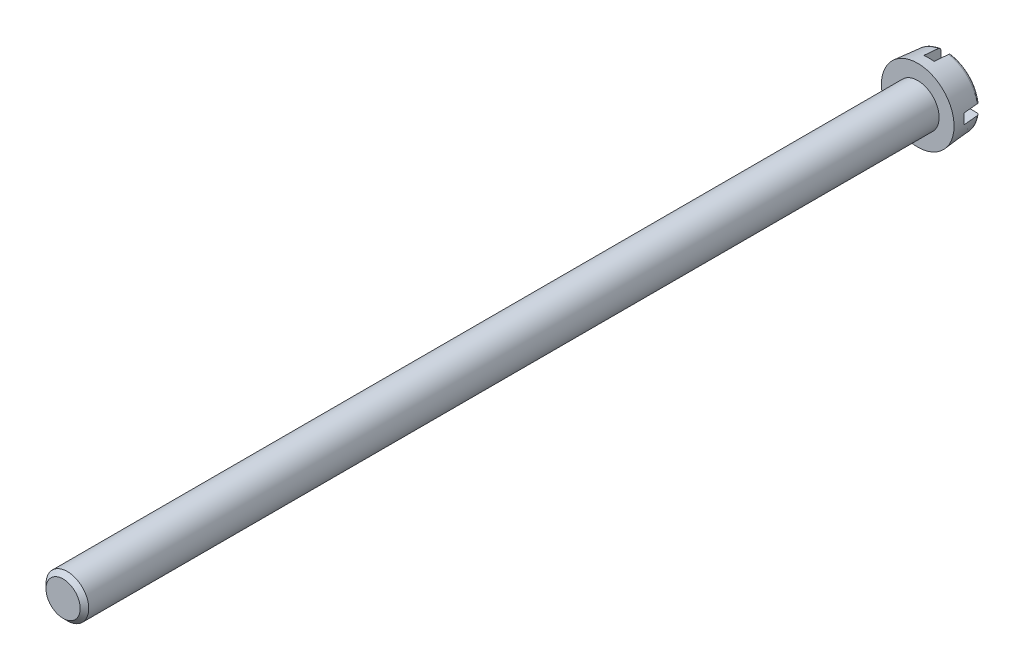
ISO-10303-21;
HEADER;
FILE_DESCRIPTION(('STEP AP214'),'2;1');
FILE_NAME('part.step','',(''),(''),'','','');
FILE_SCHEMA(('AUTOMOTIVE_DESIGN { 1 0 10303 214 1 1 1 1 }'));
ENDSEC;
DATA;
#1=APPLICATION_CONTEXT('core data for automotive mechanical design processes');
#2=APPLICATION_PROTOCOL_DEFINITION('international standard','automotive_design',2000,#1);
#3=PRODUCT_CONTEXT('',#1,'mechanical');
#4=PRODUCT('Part','Part','',(#3));
#5=PRODUCT_RELATED_PRODUCT_CATEGORY('part','',(#4));
#6=PRODUCT_DEFINITION_FORMATION('','',#4);
#7=PRODUCT_DEFINITION_CONTEXT('part definition',#1,'design');
#8=PRODUCT_DEFINITION('design','',#6,#7);
#9=PRODUCT_DEFINITION_SHAPE('','',#8);
#10=(LENGTH_UNIT() NAMED_UNIT(*) SI_UNIT(.MILLI.,.METRE.));
#11=(NAMED_UNIT(*) PLANE_ANGLE_UNIT() SI_UNIT($,.RADIAN.));
#12=(NAMED_UNIT(*) SI_UNIT($,.STERADIAN.) SOLID_ANGLE_UNIT());
#13=UNCERTAINTY_MEASURE_WITH_UNIT(LENGTH_MEASURE(1.E-05),#10,'distance_accuracy_value','');
#14=(GEOMETRIC_REPRESENTATION_CONTEXT(3) GLOBAL_UNCERTAINTY_ASSIGNED_CONTEXT((#13)) GLOBAL_UNIT_ASSIGNED_CONTEXT((#10,
#11,#12)) REPRESENTATION_CONTEXT('',''));
#15=CARTESIAN_POINT('',(0.,0.,0.));
#16=DIRECTION('',(0.,0.,1.));
#17=DIRECTION('',(1.,0.,0.));
#18=AXIS2_PLACEMENT_3D('',#15,#16,#17);
#19=CARTESIAN_POINT('',(0.,0.,-3.3));
#20=DIRECTION('',(0.,0.,1.));
#21=DIRECTION('',(1.,0.,0.));
#22=AXIS2_PLACEMENT_3D('',#19,#20,#21);
#23=PLANE('',#22);
#24=DIRECTION('',(0.,-1.,0.));
#25=VECTOR('',#24,1.);
#26=CARTESIAN_POINT('',(-0.600000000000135,4.24999999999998,-3.3));
#27=LINE('',#26,#25);
#28=CARTESIAN_POINT('',(-0.599999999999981,-0.6,-3.3));
#29=VERTEX_POINT('',#28);
#30=CARTESIAN_POINT('',(-0.599999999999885,-3.60936773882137,-3.3));
#31=VERTEX_POINT('',#30);
#32=EDGE_CURVE('E403',#29,#31,#27,.T.);
#33=ORIENTED_EDGE('',*,*,#32,.T.);
#34=CARTESIAN_POINT('',(0.,0.,-3.3));
#35=DIRECTION('',(0.,0.,-1.));
#36=DIRECTION('',(-1.,0.,0.));
#37=AXIS2_PLACEMENT_3D('',#34,#35,#36);
#38=CIRCLE('',#37,3.6588981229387);
#39=CARTESIAN_POINT('',(-3.60936773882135,-0.6,-3.3));
#40=VERTEX_POINT('',#39);
#41=EDGE_CURVE('E170',#31,#40,#38,.T.);
#42=ORIENTED_EDGE('',*,*,#41,.T.);
#43=DIRECTION('',(1.,0.,0.));
#44=VECTOR('',#43,1.);
#45=CARTESIAN_POINT('',(-4.25,-0.6,-3.3));
#46=LINE('',#45,#44);
#47=EDGE_CURVE('E308',#40,#29,#46,.T.);
#48=ORIENTED_EDGE('',*,*,#47,.T.);
#49=EDGE_LOOP('',(#33,#42,#48));
#50=FACE_BOUND('',#49,.T.);
#51=ADVANCED_FACE('F32',(#50),#23,.F.);
#52=DIRECTION('',(0.,1.,0.));
#53=VECTOR('',#52,1.);
#54=CARTESIAN_POINT('',(0.599999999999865,4.25000000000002,-3.3));
#55=LINE('',#54,#53);
#56=CARTESIAN_POINT('',(0.600000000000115,-3.60936773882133,-3.3));
#57=VERTEX_POINT('',#56);
#58=CARTESIAN_POINT('',(0.600000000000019,-0.6,-3.3));
#59=VERTEX_POINT('',#58);
#60=EDGE_CURVE('E143',#57,#59,#55,.T.);
#61=ORIENTED_EDGE('',*,*,#60,.T.);
#62=CARTESIAN_POINT('',(3.60936773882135,-0.6,-3.3));
#63=VERTEX_POINT('',#62);
#64=EDGE_CURVE('E167',#59,#63,#46,.T.);
#65=ORIENTED_EDGE('',*,*,#64,.T.);
#66=EDGE_CURVE('E160',#63,#57,#38,.T.);
#67=ORIENTED_EDGE('',*,*,#66,.T.);
#68=EDGE_LOOP('',(#61,#65,#67));
#69=FACE_BOUND('',#68,.T.);
#70=ADVANCED_FACE('F166',(#69),#23,.F.);
#71=CARTESIAN_POINT('',(-0.600000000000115,3.60936773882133,-3.3));
#72=VERTEX_POINT('',#71);
#73=CARTESIAN_POINT('',(-0.600000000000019,0.6,-3.3));
#74=VERTEX_POINT('',#73);
#75=EDGE_CURVE('E384',#72,#74,#27,.T.);
#76=ORIENTED_EDGE('',*,*,#75,.T.);
#77=DIRECTION('',(-1.,0.,0.));
#78=VECTOR('',#77,1.);
#79=CARTESIAN_POINT('',(-4.25,0.6,-3.3));
#80=LINE('',#79,#78);
#81=CARTESIAN_POINT('',(-3.60936773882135,0.6,-3.3));
#82=VERTEX_POINT('',#81);
#83=EDGE_CURVE('E311',#74,#82,#80,.T.);
#84=ORIENTED_EDGE('',*,*,#83,.T.);
#85=EDGE_CURVE('E172',#82,#72,#38,.T.);
#86=ORIENTED_EDGE('',*,*,#85,.T.);
#87=EDGE_LOOP('',(#76,#84,#86));
#88=FACE_BOUND('',#87,.T.);
#89=ADVANCED_FACE('F373',(#88),#23,.F.);
#90=CARTESIAN_POINT('',(0.599999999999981,0.6,-3.3));
#91=VERTEX_POINT('',#90);
#92=CARTESIAN_POINT('',(0.599999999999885,3.60936773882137,-3.3));
#93=VERTEX_POINT('',#92);
#94=EDGE_CURVE('E153',#91,#93,#55,.T.);
#95=ORIENTED_EDGE('',*,*,#94,.T.);
#96=CARTESIAN_POINT('',(3.60936773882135,0.6,-3.3));
#97=VERTEX_POINT('',#96);
#98=EDGE_CURVE('E169',#93,#97,#38,.T.);
#99=ORIENTED_EDGE('',*,*,#98,.T.);
#100=EDGE_CURVE('E312',#97,#91,#80,.T.);
#101=ORIENTED_EDGE('',*,*,#100,.T.);
#102=EDGE_LOOP('',(#95,#99,#101));
#103=FACE_BOUND('',#102,.T.);
#104=ADVANCED_FACE('F248',(#103),#23,.F.);
#105=CARTESIAN_POINT('',(0.,0.,-2.97));
#106=DIRECTION('',(0.,0.,-1.));
#107=DIRECTION('',(-1.,0.,0.));
#108=AXIS2_PLACEMENT_3D('',#105,#106,#107);
#109=TOROIDAL_SURFACE('',#108,3.6588981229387,0.330000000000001);
#110=CARTESIAN_POINT('',(-0.599999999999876,-3.88737338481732,-3.15315618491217));
#111=CARTESIAN_POINT('',(-0.599999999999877,-3.87692190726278,-3.16863550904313));
#112=CARTESIAN_POINT('',(-0.599999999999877,-3.86514318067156,-3.1832362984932));
#113=CARTESIAN_POINT('',(-0.599999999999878,-3.83928426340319,-3.21025767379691));
#114=CARTESIAN_POINT('',(-0.599999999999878,-3.82520102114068,-3.22267532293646));
#115=CARTESIAN_POINT('',(-0.599999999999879,-3.79516793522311,-3.24496603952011));
#116=CARTESIAN_POINT('',(-0.59999999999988,-3.77921995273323,-3.25484161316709));
#117=CARTESIAN_POINT('',(-0.599999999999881,-3.74590887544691,-3.27179913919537));
#118=CARTESIAN_POINT('',(-0.599999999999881,-3.72854612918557,-3.27888177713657));
#119=CARTESIAN_POINT('',(-0.599999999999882,-3.69272971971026,-3.29012635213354));
#120=CARTESIAN_POINT('',(-0.599999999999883,-3.6742677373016,-3.29426179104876));
#121=CARTESIAN_POINT('',(-0.599999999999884,-3.63691220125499,-3.29940555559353));
#122=CARTESIAN_POINT('',(-0.599999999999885,-3.61801860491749,-3.30041357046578));
#123=CARTESIAN_POINT('',(-0.599999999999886,-3.58015463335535,-3.29927470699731));
#124=CARTESIAN_POINT('',(-0.599999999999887,-3.56118511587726,-3.29709913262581));
#125=CARTESIAN_POINT('',(-0.599999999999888,-3.52387802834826,-3.28960096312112));
#126=CARTESIAN_POINT('',(-0.599999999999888,-3.5055404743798,-3.28427828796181));
#127=CARTESIAN_POINT('',(-0.59999999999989,-3.46998597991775,-3.2706150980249));
#128=CARTESIAN_POINT('',(-0.59999999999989,-3.45277120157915,-3.26226895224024));
#129=CARTESIAN_POINT('',(-0.599999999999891,-3.42000098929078,-3.24278445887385));
#130=CARTESIAN_POINT('',(-0.599999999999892,-3.40444550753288,-3.23164619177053));
#131=CARTESIAN_POINT('',(-0.599999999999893,-3.37556610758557,-3.20697438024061));
#132=CARTESIAN_POINT('',(-0.599999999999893,-3.36222646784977,-3.19345924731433));
#133=CARTESIAN_POINT('',(-0.599999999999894,-3.33804555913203,-3.16435271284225));
#134=CARTESIAN_POINT('',(-0.599999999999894,-3.32720409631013,-3.14876147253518));
#135=CARTESIAN_POINT('',(-0.599999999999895,-3.30849562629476,-3.11618401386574));
#136=CARTESIAN_POINT('',(-0.599999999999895,-3.30058813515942,-3.09922104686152));
#137=CARTESIAN_POINT('',(-0.599999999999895,-3.28778074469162,-3.06419539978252));
#138=CARTESIAN_POINT('',(-0.599999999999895,-3.28288057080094,-3.04613282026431));
#139=CARTESIAN_POINT('',(-0.599999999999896,-3.27629313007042,-3.00969940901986));
#140=CARTESIAN_POINT('',(-0.599999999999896,-3.27456075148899,-2.9913367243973));
#141=CARTESIAN_POINT('',(-0.599999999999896,-3.27422573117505,-2.95458330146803));
#142=CARTESIAN_POINT('',(-0.599999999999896,-3.27562293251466,-2.93619256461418));
#143=CARTESIAN_POINT('',(-0.599999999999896,-3.28148313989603,-2.90002937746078));
#144=CARTESIAN_POINT('',(-0.599999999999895,-3.28592625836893,-2.88225369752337));
#145=CARTESIAN_POINT('',(-0.599999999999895,-3.29771924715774,-2.84769494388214));
#146=CARTESIAN_POINT('',(-0.599999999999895,-3.30506915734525,-2.83091188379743));
#147=CARTESIAN_POINT('',(-0.599999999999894,-3.32249619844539,-2.79871904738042));
#148=CARTESIAN_POINT('',(-0.599999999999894,-3.33258680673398,-2.78331657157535));
#149=CARTESIAN_POINT('',(-0.599999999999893,-3.35517834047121,-2.75439506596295));
#150=CARTESIAN_POINT('',(-0.599999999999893,-3.36767942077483,-2.74087615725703));
#151=CARTESIAN_POINT('',(-0.599999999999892,-3.39491535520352,-2.71590845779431));
#152=CARTESIAN_POINT('',(-0.599999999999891,-3.40967810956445,-2.70449010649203));
#153=CARTESIAN_POINT('',(-0.599999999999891,-3.44088785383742,-2.68425089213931));
#154=CARTESIAN_POINT('',(-0.59999999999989,-3.45733497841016,-2.67543023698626));
#155=CARTESIAN_POINT('',(-0.599999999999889,-3.49170844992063,-2.66050362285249));
#156=CARTESIAN_POINT('',(-0.599999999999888,-3.50965307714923,-2.65443974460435));
#157=CARTESIAN_POINT('',(-0.599999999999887,-3.54630103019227,-2.64538000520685));
#158=CARTESIAN_POINT('',(-0.599999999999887,-3.56500440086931,-2.64238432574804));
#159=CARTESIAN_POINT('',(-0.599999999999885,-3.60282023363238,-2.63952883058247));
#160=CARTESIAN_POINT('',(-0.599999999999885,-3.62193486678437,-2.63969766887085));
#161=CARTESIAN_POINT('',(-0.599999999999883,-3.65986507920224,-2.6432415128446));
#162=CARTESIAN_POINT('',(-0.599999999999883,-3.67868065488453,-2.6466165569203));
#163=CARTESIAN_POINT('',(-0.599999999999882,-3.71547473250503,-2.65648767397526));
#164=CARTESIAN_POINT('',(-0.599999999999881,-3.73345325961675,-2.66298365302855));
#165=CARTESIAN_POINT('',(-0.59999999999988,-3.76805172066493,-2.67892556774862));
#166=CARTESIAN_POINT('',(-0.59999999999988,-3.78467169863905,-2.68837140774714));
#167=CARTESIAN_POINT('',(-0.599999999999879,-3.81593535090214,-2.70986901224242));
#168=CARTESIAN_POINT('',(-0.599999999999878,-3.83059377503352,-2.72189931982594));
#169=CARTESIAN_POINT('',(-0.599999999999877,-3.8576525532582,-2.74827691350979));
#170=CARTESIAN_POINT('',(-0.599999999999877,-3.87005304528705,-2.762624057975));
#171=CARTESIAN_POINT('',(-0.599999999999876,-3.8920875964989,-2.79304639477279));
#172=CARTESIAN_POINT('',(-0.599999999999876,-3.90175260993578,-2.80909916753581));
#173=CARTESIAN_POINT('',(-0.599999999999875,-3.91821584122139,-2.84261230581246));
#174=CARTESIAN_POINT('',(-0.599999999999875,-3.92501435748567,-2.86007252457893));
#175=CARTESIAN_POINT('',(-0.599999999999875,-3.93547904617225,-2.89570057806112));
#176=CARTESIAN_POINT('',(-0.599999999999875,-3.9391785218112,-2.91385863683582));
#177=CARTESIAN_POINT('',(-0.599999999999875,-3.94345702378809,-2.95054367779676));
#178=CARTESIAN_POINT('',(-0.599999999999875,-3.9440353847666,-2.96907073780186));
#179=CARTESIAN_POINT('',(-0.599999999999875,-3.94205870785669,-3.00585383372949));
#180=CARTESIAN_POINT('',(-0.599999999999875,-3.93952063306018,-3.02411079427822));
#181=CARTESIAN_POINT('',(-0.599999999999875,-3.93141705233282,-3.05992341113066));
#182=CARTESIAN_POINT('',(-0.599999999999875,-3.92585529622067,-3.07747990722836));
#183=CARTESIAN_POINT('',(-0.599999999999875,-3.91463478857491,-3.10472589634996));
#184=CARTESIAN_POINT('',(-0.599999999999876,-3.90987375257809,-3.11479475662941));
#185=CARTESIAN_POINT('',(-0.599999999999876,-3.899356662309,-3.13439843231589));
#186=CARTESIAN_POINT('',(-0.599999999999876,-3.89360061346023,-3.14393325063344));
#187=CARTESIAN_POINT('',(-0.599999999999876,-3.88737338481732,-3.15315618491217));
#188=B_SPLINE_CURVE_WITH_KNOTS('',3,(#110,#111,#112,#113,#114,#115,#116,#117,#118,#119,#120,
#121,#122,#123,#124,#125,#126,#127,#128,#129,#130,#131,#132,#133,#134,#135,#136,#137,#138,#139,
#140,#141,#142,#143,#144,#145,#146,#147,#148,#149,#150,#151,#152,#153,#154,#155,#156,#157,#158,
#159,#160,#161,#162,#163,#164,#165,#166,#167,#168,#169,#170,#171,#172,#173,#174,#175,#176,#177,
#178,#179,#180,#181,#182,#183,#184,#185,#186,#187),.UNSPECIFIED.,.T.,.F.,(4,2,2,2,2,2,2,2,2,2,2,
2,2,2,2,2,2,2,2,2,2,2,2,2,2,2,2,2,2,2,2,2,2,2,2,2,2,2,4),(0.,0.0559907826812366,
0.112056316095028,0.168066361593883,0.224062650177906,0.280556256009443,0.337055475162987,
0.39406711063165,0.451080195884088,0.50820001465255,0.565318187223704,0.622011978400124,
0.678701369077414,0.734576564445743,0.790446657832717,0.845514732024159,0.900580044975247,
0.955289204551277,1.00999911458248,1.0649830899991,1.11997059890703,1.17570109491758,
1.23143604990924,1.28799534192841,1.3445579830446,1.40163303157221,1.45870876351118,
1.51578277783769,1.57285494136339,1.62947042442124,1.68608244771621,1.74202560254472,
1.79796293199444,1.85329113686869,1.90863113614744,1.96367124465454,2.01864325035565,
2.05200401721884,2.08536460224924),.UNSPECIFIED.);
#189=CARTESIAN_POINT('',(-0.599999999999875,-3.94224449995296,-2.99876139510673));
#190=VERTEX_POINT('',#189);
#191=EDGE_CURVE('E300',#190,#31,#188,.T.);
#192=ORIENTED_EDGE('',*,*,#191,.F.);
#193=CARTESIAN_POINT('',(0.,0.,-2.99876139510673));
#194=DIRECTION('',(0.,0.,-1.));
#195=DIRECTION('',(-1.,0.,0.));
#196=AXIS2_PLACEMENT_3D('',#193,#194,#195);
#197=CIRCLE('',#196,3.98764237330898);
#198=CARTESIAN_POINT('',(-3.94224449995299,-0.6,-2.99876139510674));
#199=VERTEX_POINT('',#198);
#200=EDGE_CURVE('E339',#190,#199,#197,.T.);
#201=ORIENTED_EDGE('',*,*,#200,.T.);
#202=CARTESIAN_POINT('',(-3.88093121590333,-0.6,-3.16235651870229));
#203=CARTESIAN_POINT('',(-3.89174650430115,-0.6,-3.14745596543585));
#204=CARTESIAN_POINT('',(-3.90131895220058,-0.6,-3.13163782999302));
#205=CARTESIAN_POINT('',(-3.91768386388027,-0.6,-3.09860811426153));
#206=CARTESIAN_POINT('',(-3.92447332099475,-0.6,-3.08139505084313));
#207=CARTESIAN_POINT('',(-3.93505791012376,-0.6,-3.04607287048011));
#208=CARTESIAN_POINT('',(-3.93885357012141,-0.6,-3.02796391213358));
#209=CARTESIAN_POINT('',(-3.94333535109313,-0.6,-2.99136961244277));
#210=CARTESIAN_POINT('',(-3.94402220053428,-0.6,-2.97288436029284));
#211=CARTESIAN_POINT('',(-3.94227140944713,-0.6,-2.9361368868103));
#212=CARTESIAN_POINT('',(-3.93984626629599,-0.6,-2.91787406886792));
#213=CARTESIAN_POINT('',(-3.93196602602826,-0.6,-2.88201412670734));
#214=CARTESIAN_POINT('',(-3.92651084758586,-0.6,-2.86441702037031));
#215=CARTESIAN_POINT('',(-3.91272898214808,-0.6,-2.83037210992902));
#216=CARTESIAN_POINT('',(-3.90440030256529,-0.6,-2.81392511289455));
#217=CARTESIAN_POINT('',(-3.88511861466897,-0.6,-2.78264968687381));
#218=CARTESIAN_POINT('',(-3.87416553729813,-0.6,-2.76782130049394));
#219=CARTESIAN_POINT('',(-3.84986660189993,-0.6,-2.74008712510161));
#220=CARTESIAN_POINT('',(-3.83650421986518,-0.6,-2.7271958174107));
#221=CARTESIAN_POINT('',(-3.80782590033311,-0.6,-2.70380952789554));
#222=CARTESIAN_POINT('',(-3.79250985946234,-0.6,-2.69331467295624));
#223=CARTESIAN_POINT('',(-3.76017561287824,-0.6,-2.67489241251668));
#224=CARTESIAN_POINT('',(-3.74314020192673,-0.6,-2.66699520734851));
#225=CARTESIAN_POINT('',(-3.70799548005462,-0.6,-2.65413616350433));
#226=CARTESIAN_POINT('',(-3.68988609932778,-0.6,-2.64917451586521));
#227=CARTESIAN_POINT('',(-3.65288598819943,-0.6,-2.64227180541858));
#228=CARTESIAN_POINT('',(-3.63398869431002,-0.6,-2.64036590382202));
#229=CARTESIAN_POINT('',(-3.59614043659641,-0.6,-2.63972980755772));
#230=CARTESIAN_POINT('',(-3.57718947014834,-0.6,-2.64099977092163));
#231=CARTESIAN_POINT('',(-3.53963364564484,-0.6,-2.64669886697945));
#232=CARTESIAN_POINT('',(-3.52103209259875,-0.6,-2.65114981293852));
#233=CARTESIAN_POINT('',(-3.48484117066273,-0.6,-2.66311534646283));
#234=CARTESIAN_POINT('',(-3.46725181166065,-0.6,-2.67062996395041));
#235=CARTESIAN_POINT('',(-3.43361753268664,-0.6,-2.68850884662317));
#236=CARTESIAN_POINT('',(-3.41757045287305,-0.6,-2.69886904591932));
#237=CARTESIAN_POINT('',(-3.38746679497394,-0.6,-2.72216302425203));
#238=CARTESIAN_POINT('',(-3.37341012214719,-0.6,-2.73509668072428));
#239=CARTESIAN_POINT('',(-3.34784979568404,-0.6,-2.76303096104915));
#240=CARTESIAN_POINT('',(-3.33632096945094,-0.6,-2.77800854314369));
#241=CARTESIAN_POINT('',(-3.31598781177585,-0.6,-2.80971149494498));
#242=CARTESIAN_POINT('',(-3.30718323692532,-0.6,-2.82643670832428));
#243=CARTESIAN_POINT('',(-3.29269082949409,-0.6,-2.86088519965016));
#244=CARTESIAN_POINT('',(-3.28695731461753,-0.6,-2.87858926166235));
#245=CARTESIAN_POINT('',(-3.27858571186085,-0.6,-2.91471449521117));
#246=CARTESIAN_POINT('',(-3.27594737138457,-0.6,-2.93313560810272));
#247=CARTESIAN_POINT('',(-3.27386359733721,-0.6,-2.96992922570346));
#248=CARTESIAN_POINT('',(-3.27437926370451,-0.6,-2.9882995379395));
#249=CARTESIAN_POINT('',(-3.27849603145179,-0.6,-3.02469054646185));
#250=CARTESIAN_POINT('',(-3.28209704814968,-0.6,-3.04271125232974));
#251=CARTESIAN_POINT('',(-3.29225896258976,-0.6,-3.0778495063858));
#252=CARTESIAN_POINT('',(-3.2988126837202,-0.6,-3.09496913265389));
#253=CARTESIAN_POINT('',(-3.31467711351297,-0.6,-3.12787861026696));
#254=CARTESIAN_POINT('',(-3.3239879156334,-0.6,-3.14366841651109));
#255=CARTESIAN_POINT('',(-3.34518159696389,-0.6,-3.17362232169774));
#256=CARTESIAN_POINT('',(-3.35708617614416,-0.6,-3.18777106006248));
#257=CARTESIAN_POINT('',(-3.38307011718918,-0.6,-3.21390575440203));
#258=CARTESIAN_POINT('',(-3.397149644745,-0.6,-3.22589154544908));
#259=CARTESIAN_POINT('',(-3.42730774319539,-0.6,-3.24754984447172));
#260=CARTESIAN_POINT('',(-3.44341295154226,-0.6,-3.25718526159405));
#261=CARTESIAN_POINT('',(-3.47699616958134,-0.6,-3.27365724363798));
#262=CARTESIAN_POINT('',(-3.49447428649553,-0.6,-3.28049358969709));
#263=CARTESIAN_POINT('',(-3.530559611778,-0.6,-3.29126249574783));
#264=CARTESIAN_POINT('',(-3.54917882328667,-0.6,-3.29515486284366));
#265=CARTESIAN_POINT('',(-3.58680532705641,-0.6,-3.29977905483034));
#266=CARTESIAN_POINT('',(-3.60581262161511,-0.6,-3.30051086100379));
#267=CARTESIAN_POINT('',(-3.64379387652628,-0.6,-3.29878612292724));
#268=CARTESIAN_POINT('',(-3.6627669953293,-0.6,-3.29631095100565));
#269=CARTESIAN_POINT('',(-3.70003092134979,-0.6,-3.2881993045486));
#270=CARTESIAN_POINT('',(-3.71832156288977,-0.6,-3.28256206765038));
#271=CARTESIAN_POINT('',(-3.75363601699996,-0.6,-3.26829463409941));
#272=CARTESIAN_POINT('',(-3.77066317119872,-0.6,-3.25967270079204));
#273=CARTESIAN_POINT('',(-3.80299261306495,-0.6,-3.23966998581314));
#274=CARTESIAN_POINT('',(-3.81829702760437,-0.6,-3.22829266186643));
#275=CARTESIAN_POINT('',(-3.84151948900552,-0.6,-3.20772421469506));
#276=CARTESIAN_POINT('',(-3.85009030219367,-0.6,-3.19925784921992));
#277=CARTESIAN_POINT('',(-3.86626148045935,-0.6,-3.18144383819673));
#278=CARTESIAN_POINT('',(-3.87386185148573,-0.6,-3.17209619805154));
#279=CARTESIAN_POINT('',(-3.88093121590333,-0.6,-3.16235651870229));
#280=B_SPLINE_CURVE_WITH_KNOTS('',3,(#202,#203,#204,#205,#206,#207,#208,#209,#210,#211,#212,
#213,#214,#215,#216,#217,#218,#219,#220,#221,#222,#223,#224,#225,#226,#227,#228,#229,#230,#231,
#232,#233,#234,#235,#236,#237,#238,#239,#240,#241,#242,#243,#244,#245,#246,#247,#248,#249,#250,
#251,#252,#253,#254,#255,#256,#257,#258,#259,#260,#261,#262,#263,#264,#265,#266,#267,#268,#269,
#270,#271,#272,#273,#274,#275,#276,#277,#278,#279),.UNSPECIFIED.,.T.,.F.,(4,2,2,2,2,2,2,2,2,2,2,
2,2,2,2,2,2,2,2,2,2,2,2,2,2,2,2,2,2,2,2,2,2,2,2,2,2,2,4),(0.,0.055192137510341,
0.110443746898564,0.165685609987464,0.220914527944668,0.275922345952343,0.330931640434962,
0.38597915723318,0.441028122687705,0.496470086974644,0.551914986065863,0.607983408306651,
0.664055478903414,0.720768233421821,0.777483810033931,0.834592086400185,0.891700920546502,
0.948728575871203,1.00575351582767,1.06218182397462,1.11860508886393,1.17416394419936,
1.22971826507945,1.28458879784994,1.3394578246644,1.39419420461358,1.44893244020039,
1.50414752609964,1.55936682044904,1.61540809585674,1.67145375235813,1.72825141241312,
1.78504940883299,1.84217879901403,1.89932196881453,1.95630818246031,2.0132232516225,
2.04929956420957,2.08537565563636),.UNSPECIFIED.);
#281=EDGE_CURVE('E237',#40,#199,#280,.T.);
#282=ORIENTED_EDGE('',*,*,#281,.F.);
#283=ORIENTED_EDGE('',*,*,#41,.F.);
#284=EDGE_LOOP('',(#192,#201,#282,#283));
#285=FACE_BOUND('',#284,.T.);
#286=ADVANCED_FACE('F245',(#285),#109,.T.);
#287=CARTESIAN_POINT('',(0.600000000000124,-3.88737338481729,-3.15315618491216));
#288=CARTESIAN_POINT('',(0.600000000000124,-3.89766789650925,-3.13790637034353));
#289=CARTESIAN_POINT('',(0.600000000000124,-3.90668940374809,-3.12178204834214));
#290=CARTESIAN_POINT('',(0.600000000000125,-3.92190792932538,-3.08823622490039));
#291=CARTESIAN_POINT('',(0.600000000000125,-3.92810188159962,-3.07081333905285));
#292=CARTESIAN_POINT('',(0.600000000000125,-3.93746890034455,-3.03517530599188));
#293=CARTESIAN_POINT('',(0.600000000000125,-3.94064257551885,-3.01696031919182));
#294=CARTESIAN_POINT('',(0.600000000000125,-3.94387307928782,-2.98026047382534));
#295=CARTESIAN_POINT('',(0.600000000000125,-3.94393063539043,-2.96177567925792));
#296=CARTESIAN_POINT('',(0.600000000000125,-3.94093477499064,-2.92512628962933));
#297=CARTESIAN_POINT('',(0.600000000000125,-3.93789239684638,-2.90696079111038));
#298=CARTESIAN_POINT('',(0.600000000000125,-3.92880491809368,-2.87139694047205));
#299=CARTESIAN_POINT('',(0.600000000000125,-3.92275972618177,-2.85399861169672));
#300=CARTESIAN_POINT('',(0.600000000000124,-3.90783664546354,-2.82043414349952));
#301=CARTESIAN_POINT('',(0.600000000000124,-3.89895483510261,-2.80426974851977));
#302=CARTESIAN_POINT('',(0.600000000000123,-3.87862314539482,-2.77364663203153));
#303=CARTESIAN_POINT('',(0.600000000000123,-3.86717319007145,-2.75918796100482));
#304=CARTESIAN_POINT('',(0.600000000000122,-3.84193996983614,-2.73226433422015));
#305=CARTESIAN_POINT('',(0.600000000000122,-3.82813944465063,-2.71981555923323));
#306=CARTESIAN_POINT('',(0.600000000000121,-3.79866473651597,-2.69738025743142));
#307=CARTESIAN_POINT('',(0.60000000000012,-3.78299045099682,-2.68739386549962));
#308=CARTESIAN_POINT('',(0.600000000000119,-3.75002159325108,-2.67004429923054));
#309=CARTESIAN_POINT('',(0.600000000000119,-3.73271050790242,-2.66271250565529));
#310=CARTESIAN_POINT('',(0.600000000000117,-3.69711184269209,-2.6510228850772));
#311=CARTESIAN_POINT('',(0.600000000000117,-3.67882419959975,-2.64666525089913));
#312=CARTESIAN_POINT('',(0.600000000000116,-3.64157260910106,-2.64100111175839));
#313=CARTESIAN_POINT('',(0.600000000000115,-3.6226033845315,-2.63972928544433));
#314=CARTESIAN_POINT('',(0.600000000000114,-3.58471811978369,-2.64036675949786));
#315=CARTESIAN_POINT('',(0.600000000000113,-3.56580208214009,-2.64227620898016));
#316=CARTESIAN_POINT('',(0.600000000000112,-3.5284367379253,-2.64924518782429));
#317=CARTESIAN_POINT('',(0.600000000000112,-3.50999107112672,-2.65432425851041));
#318=CARTESIAN_POINT('',(0.60000000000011,-3.47421665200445,-2.66751388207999));
#319=CARTESIAN_POINT('',(0.60000000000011,-3.45688790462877,-2.67562444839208));
#320=CARTESIAN_POINT('',(0.600000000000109,-3.42388967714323,-2.69463670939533));
#321=CARTESIAN_POINT('',(0.600000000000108,-3.40821636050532,-2.70553174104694));
#322=CARTESIAN_POINT('',(0.600000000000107,-3.3789475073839,-2.72982612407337));
#323=CARTESIAN_POINT('',(0.600000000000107,-3.36535186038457,-2.74322534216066));
#324=CARTESIAN_POINT('',(0.600000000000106,-3.34079322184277,-2.77199142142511));
#325=CARTESIAN_POINT('',(0.600000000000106,-3.32980239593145,-2.78733451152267));
#326=CARTESIAN_POINT('',(0.600000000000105,-3.31060007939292,-2.81967143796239));
#327=CARTESIAN_POINT('',(0.600000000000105,-3.30238833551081,-2.83666512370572));
#328=CARTESIAN_POINT('',(0.600000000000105,-3.2891094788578,-2.87153970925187));
#329=CARTESIAN_POINT('',(0.600000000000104,-3.28399588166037,-2.88940291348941));
#330=CARTESIAN_POINT('',(0.600000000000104,-3.27687966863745,-2.92573833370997));
#331=CARTESIAN_POINT('',(0.600000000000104,-3.27487681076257,-2.9442105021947));
#332=CARTESIAN_POINT('',(0.600000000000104,-3.27405087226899,-2.98101123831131));
#333=CARTESIAN_POINT('',(0.600000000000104,-3.27519130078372,-2.99933899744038));
#334=CARTESIAN_POINT('',(0.600000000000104,-3.28053770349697,-3.03554119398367));
#335=CARTESIAN_POINT('',(0.600000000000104,-3.28474361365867,-3.05341564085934));
#336=CARTESIAN_POINT('',(0.600000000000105,-3.29608237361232,-3.08818506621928));
#337=CARTESIAN_POINT('',(0.600000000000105,-3.30321158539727,-3.10508123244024));
#338=CARTESIAN_POINT('',(0.600000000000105,-3.32017922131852,-3.1374527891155));
#339=CARTESIAN_POINT('',(0.600000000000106,-3.33001775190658,-3.15292812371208));
#340=CARTESIAN_POINT('',(0.600000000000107,-3.35221962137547,-3.18218302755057));
#341=CARTESIAN_POINT('',(0.600000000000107,-3.36460637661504,-3.19594481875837));
#342=CARTESIAN_POINT('',(0.600000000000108,-3.39148365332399,-3.22123181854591));
#343=CARTESIAN_POINT('',(0.600000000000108,-3.40597433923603,-3.23275685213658));
#344=CARTESIAN_POINT('',(0.600000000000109,-3.43688218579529,-3.25342722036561));
#345=CARTESIAN_POINT('',(0.60000000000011,-3.45332511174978,-3.26253403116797));
#346=CARTESIAN_POINT('',(0.600000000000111,-3.48749221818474,-3.27789857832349));
#347=CARTESIAN_POINT('',(0.600000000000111,-3.50521649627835,-3.28415609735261));
#348=CARTESIAN_POINT('',(0.600000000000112,-3.54168879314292,-3.29372103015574));
#349=CARTESIAN_POINT('',(0.600000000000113,-3.56044705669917,-3.29698941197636));
#350=CARTESIAN_POINT('',(0.600000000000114,-3.59824566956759,-3.30034809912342));
#351=CARTESIAN_POINT('',(0.600000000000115,-3.61728601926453,-3.30043840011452));
#352=CARTESIAN_POINT('',(0.600000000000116,-3.65520754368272,-3.29742726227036));
#353=CARTESIAN_POINT('',(0.600000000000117,-3.67408747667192,-3.29431013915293));
#354=CARTESIAN_POINT('',(0.600000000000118,-3.71105726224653,-3.28493650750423));
#355=CARTESIAN_POINT('',(0.600000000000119,-3.7291469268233,-3.27867925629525));
#356=CARTESIAN_POINT('',(0.60000000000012,-3.7639416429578,-3.26321959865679));
#357=CARTESIAN_POINT('',(0.60000000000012,-3.78065142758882,-3.25402783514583));
#358=CARTESIAN_POINT('',(0.600000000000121,-3.81225324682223,-3.23294688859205));
#359=CARTESIAN_POINT('',(0.600000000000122,-3.82714753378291,-3.22106110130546));
#360=CARTESIAN_POINT('',(0.600000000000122,-3.84962039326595,-3.19973727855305));
#361=CARTESIAN_POINT('',(0.600000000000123,-3.85787740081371,-3.19100238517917));
#362=CARTESIAN_POINT('',(0.600000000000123,-3.87339478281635,-3.17268786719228));
#363=CARTESIAN_POINT('',(0.600000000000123,-3.88065516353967,-3.16310824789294));
#364=CARTESIAN_POINT('',(0.600000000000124,-3.88737338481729,-3.15315618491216));
#365=B_SPLINE_CURVE_WITH_KNOTS('',3,(#287,#288,#289,#290,#291,#292,#293,#294,#295,#296,#297,
#298,#299,#300,#301,#302,#303,#304,#305,#306,#307,#308,#309,#310,#311,#312,#313,#314,#315,#316,
#317,#318,#319,#320,#321,#322,#323,#324,#325,#326,#327,#328,#329,#330,#331,#332,#333,#334,#335,
#336,#337,#338,#339,#340,#341,#342,#343,#344,#345,#346,#347,#348,#349,#350,#351,#352,#353,#354,
#355,#356,#357,#358,#359,#360,#361,#362,#363,#364),.UNSPECIFIED.,.T.,.F.,(4,2,2,2,2,2,2,2,2,2,2,
2,2,2,2,2,2,2,2,2,2,2,2,2,2,2,2,2,2,2,2,2,2,2,2,2,2,2,4),(0.,0.0551544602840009,
0.110368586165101,0.165571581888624,0.22076168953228,0.275755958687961,0.330751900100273,
0.385824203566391,0.44089813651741,0.496395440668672,0.551895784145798,0.608032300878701,
0.664172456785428,0.720940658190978,0.777711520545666,0.834835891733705,0.891960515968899,
0.948949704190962,1.00593585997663,1.06228244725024,1.1186238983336,1.17409760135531,
1.22956698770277,1.28439514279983,1.33922215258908,1.39398113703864,1.44874227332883,
1.50403110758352,1.55932426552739,1.61545159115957,1.6715831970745,1.72843771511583,
1.78529231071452,1.84242625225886,1.89957371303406,1.95651622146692,2.01338735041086,
2.04938150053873,2.08537542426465),.UNSPECIFIED.);
#366=CARTESIAN_POINT('',(0.600000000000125,-3.94224449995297,-2.99876139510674));
#367=VERTEX_POINT('',#366);
#368=EDGE_CURVE('E146',#57,#367,#365,.T.);
#369=ORIENTED_EDGE('',*,*,#368,.F.);
#370=ORIENTED_EDGE('',*,*,#66,.F.);
#371=CARTESIAN_POINT('',(3.29440264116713,-0.6,-3.08230315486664));
#372=CARTESIAN_POINT('',(3.28809785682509,-0.6,-3.0651620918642));
#373=CARTESIAN_POINT('',(3.28322982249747,-0.6,-3.04747923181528));
#374=CARTESIAN_POINT('',(3.27652850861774,-0.6,-3.01153352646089));
#375=CARTESIAN_POINT('',(3.27469849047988,-0.6,-2.99327007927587));
#376=CARTESIAN_POINT('',(3.27413756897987,-0.6,-2.95670045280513));
#377=CARTESIAN_POINT('',(3.27540558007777,-0.6,-2.93839429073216));
#378=CARTESIAN_POINT('',(3.28099874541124,-0.6,-2.90226005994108));
#379=CARTESIAN_POINT('',(3.28532324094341,-0.6,-2.88443188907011));
#380=CARTESIAN_POINT('',(3.29689219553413,-0.6,-2.84975492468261));
#381=CARTESIAN_POINT('',(3.30413599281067,-0.6,-2.8329059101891));
#382=CARTESIAN_POINT('',(3.3213231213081,-0.6,-2.80064624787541));
#383=CARTESIAN_POINT('',(3.33126664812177,-0.6,-2.7852357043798));
#384=CARTESIAN_POINT('',(3.35366868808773,-0.6,-2.75612471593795));
#385=CARTESIAN_POINT('',(3.3661508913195,-0.6,-2.74244250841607));
#386=CARTESIAN_POINT('',(3.3932045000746,-0.6,-2.71732930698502));
#387=CARTESIAN_POINT('',(3.40777606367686,-0.6,-2.7058984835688));
#388=CARTESIAN_POINT('',(3.4388307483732,-0.6,-2.6854297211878));
#389=CARTESIAN_POINT('',(3.45533944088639,-0.6,-2.67643057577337));
#390=CARTESIAN_POINT('',(3.48961941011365,-0.6,-2.66129114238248));
#391=CARTESIAN_POINT('',(3.50739077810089,-0.6,-2.65515106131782));
#392=CARTESIAN_POINT('',(3.54393539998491,-0.6,-2.64582999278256));
#393=CARTESIAN_POINT('',(3.56271853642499,-0.6,-2.64268771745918));
#394=CARTESIAN_POINT('',(3.60054621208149,-0.6,-2.63958409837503));
#395=CARTESIAN_POINT('',(3.61959076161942,-0.6,-2.63962288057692));
#396=CARTESIAN_POINT('',(3.65749738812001,-0.6,-2.64289265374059));
#397=CARTESIAN_POINT('',(3.6763581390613,-0.6,-2.64613906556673));
#398=CARTESIAN_POINT('',(3.71326281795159,-0.6,-2.65576554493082));
#399=CARTESIAN_POINT('',(3.73130675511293,-0.6,-2.66214557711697));
#400=CARTESIAN_POINT('',(3.76597993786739,-0.6,-2.67783761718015));
#401=CARTESIAN_POINT('',(3.78261484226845,-0.6,-2.68713711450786));
#402=CARTESIAN_POINT('',(3.81406528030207,-0.6,-2.70842491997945));
#403=CARTESIAN_POINT('',(3.82888090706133,-0.6,-2.72041309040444));
#404=CARTESIAN_POINT('',(3.85610446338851,-0.6,-2.74660594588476));
#405=CARTESIAN_POINT('',(3.8685359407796,-0.6,-2.76078615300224));
#406=CARTESIAN_POINT('',(3.89080726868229,-0.6,-2.79105382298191));
#407=CARTESIAN_POINT('',(3.90064729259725,-0.6,-2.80714115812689));
#408=CARTESIAN_POINT('',(3.91733416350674,-0.6,-2.8405601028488));
#409=CARTESIAN_POINT('',(3.92421525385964,-0.6,-2.85787461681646));
#410=CARTESIAN_POINT('',(3.93494358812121,-0.6,-2.89341927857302));
#411=CARTESIAN_POINT('',(3.93879100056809,-0.6,-2.91164937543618));
#412=CARTESIAN_POINT('',(3.94331406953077,-0.6,-2.94833527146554));
#413=CARTESIAN_POINT('',(3.94401737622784,-0.6,-2.9667876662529));
#414=CARTESIAN_POINT('',(3.94230652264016,-0.6,-3.00354703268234));
#415=CARTESIAN_POINT('',(3.9398924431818,-0.6,-3.02185400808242));
#416=CARTESIAN_POINT('',(3.93203104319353,-0.6,-3.05775084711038));
#417=CARTESIAN_POINT('',(3.92659214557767,-0.6,-3.07534255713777));
#418=CARTESIAN_POINT('',(3.91284977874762,-0.6,-3.10936852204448));
#419=CARTESIAN_POINT('',(3.90454627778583,-0.6,-3.12580276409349));
#420=CARTESIAN_POINT('',(3.88528034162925,-0.6,-3.15712284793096));
#421=CARTESIAN_POINT('',(3.87430720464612,-0.6,-3.17200210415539));
#422=CARTESIAN_POINT('',(3.8500405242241,-0.6,-3.19972912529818));
#423=CARTESIAN_POINT('',(3.83674688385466,-0.6,-3.21257680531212));
#424=CARTESIAN_POINT('',(3.80808268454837,-0.6,-3.2360101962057));
#425=CARTESIAN_POINT('',(3.79269344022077,-0.6,-3.24657304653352));
#426=CARTESIAN_POINT('',(3.76037673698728,-0.6,-3.26500063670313));
#427=CARTESIAN_POINT('',(3.74344917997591,-0.6,-3.27286520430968));
#428=CARTESIAN_POINT('',(3.70832088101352,-0.6,-3.28577099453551));
#429=CARTESIAN_POINT('',(3.69010738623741,-0.6,-3.29077750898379));
#430=CARTESIAN_POINT('',(3.6531016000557,-0.6,-3.29769462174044));
#431=CARTESIAN_POINT('',(3.63430927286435,-0.6,-3.2996050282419));
#432=CARTESIAN_POINT('',(3.5964831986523,-0.6,-3.30028781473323));
#433=CARTESIAN_POINT('',(3.57744888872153,-0.6,-3.29902930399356));
#434=CARTESIAN_POINT('',(3.53985927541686,-0.6,-3.29334556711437));
#435=CARTESIAN_POINT('',(3.52130396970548,-0.6,-3.28892035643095));
#436=CARTESIAN_POINT('',(3.48514277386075,-0.6,-3.27700380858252));
#437=CARTESIAN_POINT('',(3.46753990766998,-0.6,-3.2695032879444));
#438=CARTESIAN_POINT('',(3.43384889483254,-0.6,-3.2516337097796));
#439=CARTESIAN_POINT('',(3.4177610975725,-0.6,-3.24126399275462));
#440=CARTESIAN_POINT('',(3.38766821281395,-0.6,-3.21800708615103));
#441=CARTESIAN_POINT('',(3.37365189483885,-0.6,-3.20513441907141));
#442=CARTESIAN_POINT('',(3.34803025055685,-0.6,-3.17719862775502));
#443=CARTESIAN_POINT('',(3.33642183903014,-0.6,-3.16213834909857));
#444=CARTESIAN_POINT('',(3.31975710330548,-0.6,-3.13617199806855));
#445=CARTESIAN_POINT('',(3.31386604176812,-0.6,-3.125791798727));
#446=CARTESIAN_POINT('',(3.30324676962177,-0.6,-3.10445241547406));
#447=CARTESIAN_POINT('',(3.29851854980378,-0.6,-3.09349323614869));
#448=CARTESIAN_POINT('',(3.29440264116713,-0.6,-3.08230315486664));
#449=B_SPLINE_CURVE_WITH_KNOTS('',3,(#371,#372,#373,#374,#375,#376,#377,#378,#379,#380,#381,
#382,#383,#384,#385,#386,#387,#388,#389,#390,#391,#392,#393,#394,#395,#396,#397,#398,#399,#400,
#401,#402,#403,#404,#405,#406,#407,#408,#409,#410,#411,#412,#413,#414,#415,#416,#417,#418,#419,
#420,#421,#422,#423,#424,#425,#426,#427,#428,#429,#430,#431,#432,#433,#434,#435,#436,#437,#438,
#439,#440,#441,#442,#443,#444,#445,#446,#447,#448),.UNSPECIFIED.,.T.,.F.,(4,2,2,2,2,2,2,2,2,2,2,
2,2,2,2,2,2,2,2,2,2,2,2,2,2,2,2,2,2,2,2,2,2,2,2,2,2,2,4),(0.,0.0547481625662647,
0.109555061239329,0.164342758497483,0.21911865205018,0.273882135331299,0.32864958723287,
0.383953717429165,0.439262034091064,0.495406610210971,0.551555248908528,0.608419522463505,
0.665286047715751,0.722427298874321,0.779567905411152,0.836466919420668,0.893363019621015,
0.949664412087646,1.00596203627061,1.06158935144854,1.11721357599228,1.17234765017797,
1.22748029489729,1.28246018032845,1.33744067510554,1.39264531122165,1.44785225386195,
1.50358833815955,1.55932797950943,1.61573086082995,1.67213723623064,1.72909558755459,
1.78605366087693,1.84318307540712,1.90032563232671,1.9571460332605,2.01389317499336,
2.04963432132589,2.08537518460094),.UNSPECIFIED.);
#450=CARTESIAN_POINT('',(3.94224449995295,-0.6,-2.99876139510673));
#451=VERTEX_POINT('',#450);
#452=EDGE_CURVE('E233',#451,#63,#449,.T.);
#453=ORIENTED_EDGE('',*,*,#452,.F.);
#454=EDGE_CURVE('E162',#451,#367,#197,.T.);
#455=ORIENTED_EDGE('',*,*,#454,.T.);
#456=EDGE_LOOP('',(#369,#370,#453,#455));
#457=FACE_BOUND('',#456,.T.);
#458=ADVANCED_FACE('F158',(#457),#109,.T.);
#459=CARTESIAN_POINT('',(-0.600000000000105,3.30961279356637,-3.11722594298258));
#460=CARTESIAN_POINT('',(-0.600000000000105,3.318039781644,-3.1338575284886));
#461=CARTESIAN_POINT('',(-0.600000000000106,3.32789470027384,-3.14978218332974));
#462=CARTESIAN_POINT('',(-0.600000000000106,3.35015703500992,-3.17975592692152));
#463=CARTESIAN_POINT('',(-0.600000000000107,3.36256794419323,-3.19380240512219));
#464=CARTESIAN_POINT('',(-0.600000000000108,3.38955022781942,-3.21960656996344));
#465=CARTESIAN_POINT('',(-0.600000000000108,3.40411914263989,-3.23136682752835));
#466=CARTESIAN_POINT('',(-0.600000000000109,3.43500137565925,-3.25230269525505));
#467=CARTESIAN_POINT('',(-0.60000000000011,3.45131426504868,-3.26147893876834));
#468=CARTESIAN_POINT('',(-0.600000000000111,3.48541847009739,-3.27710060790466));
#469=CARTESIAN_POINT('',(-0.600000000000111,3.5032241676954,-3.28351463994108));
#470=CARTESIAN_POINT('',(-0.600000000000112,3.53965489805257,-3.29329484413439));
#471=CARTESIAN_POINT('',(-0.600000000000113,3.55828001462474,-3.29666070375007));
#472=CARTESIAN_POINT('',(-0.600000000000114,3.59601064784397,-3.30027122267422));
#473=CARTESIAN_POINT('',(-0.600000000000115,3.61511905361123,-3.30048576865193));
#474=CARTESIAN_POINT('',(-0.600000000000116,3.65310153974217,-3.29770617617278));
#475=CARTESIAN_POINT('',(-0.600000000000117,3.67197561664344,-3.29471199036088));
#476=CARTESIAN_POINT('',(-0.600000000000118,3.70896109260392,-3.28558723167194));
#477=CARTESIAN_POINT('',(-0.600000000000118,3.72707208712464,-3.27945501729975));
#478=CARTESIAN_POINT('',(-0.60000000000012,3.76199571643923,-3.26421416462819));
#479=CARTESIAN_POINT('',(-0.60000000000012,3.77880839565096,-3.25510562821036));
#480=CARTESIAN_POINT('',(-0.600000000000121,3.81051738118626,-3.23423959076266));
#481=CARTESIAN_POINT('',(-0.600000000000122,3.82542731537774,-3.22250280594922));
#482=CARTESIAN_POINT('',(-0.600000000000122,3.85303560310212,-3.19666545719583));
#483=CARTESIAN_POINT('',(-0.600000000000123,3.8657340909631,-3.18256503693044));
#484=CARTESIAN_POINT('',(-0.600000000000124,3.88839956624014,-3.15257794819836));
#485=CARTESIAN_POINT('',(-0.600000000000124,3.89839688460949,-3.1367142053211));
#486=CARTESIAN_POINT('',(-0.600000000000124,3.9155518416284,-3.10351908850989));
#487=CARTESIAN_POINT('',(-0.600000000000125,3.92270966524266,-3.08618781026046));
#488=CARTESIAN_POINT('',(-0.600000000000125,3.93390394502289,-3.05075446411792));
#489=CARTESIAN_POINT('',(-0.600000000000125,3.93797378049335,-3.03266293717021));
#490=CARTESIAN_POINT('',(-0.600000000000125,3.94299702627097,-2.99605247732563));
#491=CARTESIAN_POINT('',(-0.600000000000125,3.94395057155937,-2.97753356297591));
#492=CARTESIAN_POINT('',(-0.600000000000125,3.94271628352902,-2.94071754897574));
#493=CARTESIAN_POINT('',(-0.600000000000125,3.94054810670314,-2.92241978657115));
#494=CARTESIAN_POINT('',(-0.600000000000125,3.93317147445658,-2.88644815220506));
#495=CARTESIAN_POINT('',(-0.600000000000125,3.92796304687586,-2.86877427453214));
#496=CARTESIAN_POINT('',(-0.600000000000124,3.91465918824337,-2.83454088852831));
#497=CARTESIAN_POINT('',(-0.600000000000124,3.90656255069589,-2.81798184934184));
#498=CARTESIAN_POINT('',(-0.600000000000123,3.88772238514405,-2.78644565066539));
#499=CARTESIAN_POINT('',(-0.600000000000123,3.87697878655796,-2.77146853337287));
#500=CARTESIAN_POINT('',(-0.600000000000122,3.85307477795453,-2.74340705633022));
#501=CARTESIAN_POINT('',(-0.600000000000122,3.83989819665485,-2.73033647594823));
#502=CARTESIAN_POINT('',(-0.600000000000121,3.81155893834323,-2.70656356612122));
#503=CARTESIAN_POINT('',(-0.600000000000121,3.79639615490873,-2.6958613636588));
#504=CARTESIAN_POINT('',(-0.60000000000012,3.76433515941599,-2.67700072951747));
#505=CARTESIAN_POINT('',(-0.600000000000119,3.74741949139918,-2.66887197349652));
#506=CARTESIAN_POINT('',(-0.600000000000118,3.71247428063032,-2.65553293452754));
#507=CARTESIAN_POINT('',(-0.600000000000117,3.69444466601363,-2.65032284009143));
#508=CARTESIAN_POINT('',(-0.600000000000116,3.65756114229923,-2.64290962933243));
#509=CARTESIAN_POINT('',(-0.600000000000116,3.63870013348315,-2.64074181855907));
#510=CARTESIAN_POINT('',(-0.600000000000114,3.60088027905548,-2.63957860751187));
#511=CARTESIAN_POINT('',(-0.600000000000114,3.58192142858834,-2.64058336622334));
#512=CARTESIAN_POINT('',(-0.600000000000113,3.54430004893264,-2.64575446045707));
#513=CARTESIAN_POINT('',(-0.600000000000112,3.52564063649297,-2.64994350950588));
#514=CARTESIAN_POINT('',(-0.600000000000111,3.4892902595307,-2.66139745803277));
#515=CARTESIAN_POINT('',(-0.60000000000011,3.47159930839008,-2.66866240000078));
#516=CARTESIAN_POINT('',(-0.600000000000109,3.43771367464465,-2.68606473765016));
#517=CARTESIAN_POINT('',(-0.600000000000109,3.42151746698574,-2.6961991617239));
#518=CARTESIAN_POINT('',(-0.600000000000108,3.39107858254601,-2.71906932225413));
#519=CARTESIAN_POINT('',(-0.600000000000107,3.37683582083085,-2.7318049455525));
#520=CARTESIAN_POINT('',(-0.600000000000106,3.35086864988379,-2.7593837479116));
#521=CARTESIAN_POINT('',(-0.600000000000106,3.33912022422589,-2.77420430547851));
#522=CARTESIAN_POINT('',(-0.600000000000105,3.31832456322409,-2.8056323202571));
#523=CARTESIAN_POINT('',(-0.600000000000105,3.30927698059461,-2.82223954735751));
#524=CARTESIAN_POINT('',(-0.600000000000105,3.2942861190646,-2.85649612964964));
#525=CARTESIAN_POINT('',(-0.600000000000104,3.28829726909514,-2.87412554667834));
#526=CARTESIAN_POINT('',(-0.600000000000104,3.27940563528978,-2.91015126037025));
#527=CARTESIAN_POINT('',(-0.600000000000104,3.27650338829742,-2.92854768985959));
#528=CARTESIAN_POINT('',(-0.600000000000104,3.27389581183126,-2.96533915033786));
#529=CARTESIAN_POINT('',(-0.600000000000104,3.27415218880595,-2.98373149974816));
#530=CARTESIAN_POINT('',(-0.600000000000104,3.2777619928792,-3.02019345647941));
#531=CARTESIAN_POINT('',(-0.600000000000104,3.28111148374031,-3.0382634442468));
#532=CARTESIAN_POINT('',(-0.600000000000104,3.28884848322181,-3.06649660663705));
#533=CARTESIAN_POINT('',(-0.600000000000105,3.29228426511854,-3.07693024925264));
#534=CARTESIAN_POINT('',(-0.600000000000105,3.30018602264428,-3.09739956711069));
#535=CARTESIAN_POINT('',(-0.600000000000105,3.30465198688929,-3.10743524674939));
#536=CARTESIAN_POINT('',(-0.600000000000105,3.30961279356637,-3.11722594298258));
#537=B_SPLINE_CURVE_WITH_KNOTS('',3,(#459,#460,#461,#462,#463,#464,#465,#466,#467,#468,#469,
#470,#471,#472,#473,#474,#475,#476,#477,#478,#479,#480,#481,#482,#483,#484,#485,#486,#487,#488,
#489,#490,#491,#492,#493,#494,#495,#496,#497,#498,#499,#500,#501,#502,#503,#504,#505,#506,#507,
#508,#509,#510,#511,#512,#513,#514,#515,#516,#517,#518,#519,#520,#521,#522,#523,#524,#525,#526,
#527,#528,#529,#530,#531,#532,#533,#534,#535,#536),.UNSPECIFIED.,.T.,.F.,(4,2,2,2,2,2,2,2,2,2,2,
2,2,2,2,2,2,2,2,2,2,2,2,2,2,2,2,2,2,2,2,2,2,2,2,2,2,2,4),(0.,0.0558931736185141,
0.111863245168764,0.167770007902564,0.223663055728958,0.280175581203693,0.336693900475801,
0.393751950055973,0.450810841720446,0.507899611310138,0.564986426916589,0.621638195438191,
0.678286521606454,0.73426948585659,0.790248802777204,0.845614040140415,0.900976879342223,
0.955992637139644,1.01100789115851,1.06604615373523,1.12108588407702,1.17650555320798,
1.23192819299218,1.28796843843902,1.34401230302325,1.4007013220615,1.45739318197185,
1.51449326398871,1.57159413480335,1.62863608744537,1.68567555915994,1.7421380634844,
1.79859330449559,1.85418092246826,1.90977820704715,1.96470212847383,2.019556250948,
2.05245985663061,2.08536309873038),.UNSPECIFIED.);
#538=CARTESIAN_POINT('',(-0.600000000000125,3.94224449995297,-2.99876139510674));
#539=VERTEX_POINT('',#538);
#540=EDGE_CURVE('E274',#72,#539,#537,.T.);
#541=ORIENTED_EDGE('',*,*,#540,.F.);
#542=ORIENTED_EDGE('',*,*,#85,.F.);
#543=CARTESIAN_POINT('',(-3.88093121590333,0.6,-3.16235651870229));
#544=CARTESIAN_POINT('',(-3.86994562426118,0.6,-3.17748883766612));
#545=CARTESIAN_POINT('',(-3.8576617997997,0.6,-3.19169676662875));
#546=CARTESIAN_POINT('',(-3.83086570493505,0.6,-3.21785274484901));
#547=CARTESIAN_POINT('',(-3.81635047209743,0.6,-3.2297977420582));
#548=CARTESIAN_POINT('',(-3.78553913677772,0.6,-3.25107812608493));
#549=CARTESIAN_POINT('',(-3.76924481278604,0.6,-3.26041608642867));
#550=CARTESIAN_POINT('',(-3.73533536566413,0.6,-3.27624833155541));
#551=CARTESIAN_POINT('',(-3.71772056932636,0.6,-3.28274331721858));
#552=CARTESIAN_POINT('',(-3.68149968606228,0.6,-3.29277255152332));
#553=CARTESIAN_POINT('',(-3.66288621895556,0.6,-3.29628014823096));
#554=CARTESIAN_POINT('',(-3.62533412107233,0.6,-3.3001499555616));
#555=CARTESIAN_POINT('',(-3.60639545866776,0.6,-3.30051185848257));
#556=CARTESIAN_POINT('',(-3.56856016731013,0.6,-3.29807389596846));
#557=CARTESIAN_POINT('',(-3.54966526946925,0.6,-3.29524708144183));
#558=CARTESIAN_POINT('',(-3.51261639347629,0.6,-3.2864651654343));
#559=CARTESIAN_POINT('',(-3.49446243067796,0.6,-3.28050999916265));
#560=CARTESIAN_POINT('',(-3.45939741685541,0.6,-3.26562312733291));
#561=CARTESIAN_POINT('',(-3.44248757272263,0.6,-3.25668857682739));
#562=CARTESIAN_POINT('',(-3.41042432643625,0.6,-3.23608480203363));
#563=CARTESIAN_POINT('',(-3.39527086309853,0.6,-3.22441567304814));
#564=CARTESIAN_POINT('',(-3.36729252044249,0.6,-3.19877091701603));
#565=CARTESIAN_POINT('',(-3.35444928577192,0.6,-3.18481532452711));
#566=CARTESIAN_POINT('',(-3.33133020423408,0.6,-3.15491819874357));
#567=CARTESIAN_POINT('',(-3.32105414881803,0.6,-3.13897682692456));
#568=CARTESIAN_POINT('',(-3.30352389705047,0.6,-3.10581171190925));
#569=CARTESIAN_POINT('',(-3.29622739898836,0.6,-3.08861032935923));
#570=CARTESIAN_POINT('',(-3.28467217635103,0.6,-3.05321591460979));
#571=CARTESIAN_POINT('',(-3.28041318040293,0.6,-3.03502297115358));
#572=CARTESIAN_POINT('',(-3.27510706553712,0.6,-2.99843307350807));
#573=CARTESIAN_POINT('',(-3.2740161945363,0.6,-2.9800424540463));
#574=CARTESIAN_POINT('',(-3.27495596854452,0.6,-2.9433416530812));
#575=CARTESIAN_POINT('',(-3.27698647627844,0.6,-2.92503146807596));
#576=CARTESIAN_POINT('',(-3.28408517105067,0.6,-2.88911263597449));
#577=CARTESIAN_POINT('',(-3.28913704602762,0.6,-2.8715007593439));
#578=CARTESIAN_POINT('',(-3.30210833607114,0.6,-2.83736742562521));
#579=CARTESIAN_POINT('',(-3.31002780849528,0.6,-2.8208459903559));
#580=CARTESIAN_POINT('',(-3.32855183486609,0.6,-2.78924869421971));
#581=CARTESIAN_POINT('',(-3.33917251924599,0.6,-2.77418229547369));
#582=CARTESIAN_POINT('',(-3.36276008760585,0.6,-2.74601486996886));
#583=CARTESIAN_POINT('',(-3.37572713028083,0.6,-2.73291397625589));
#584=CARTESIAN_POINT('',(-3.40383191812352,0.6,-2.70885221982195));
#585=CARTESIAN_POINT('',(-3.41899752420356,0.6,-2.69792390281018));
#586=CARTESIAN_POINT('',(-3.45092687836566,0.6,-2.67872542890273));
#587=CARTESIAN_POINT('',(-3.46769075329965,0.6,-2.67045548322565));
#588=CARTESIAN_POINT('',(-3.50260223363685,0.6,-2.65668752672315));
#589=CARTESIAN_POINT('',(-3.52076636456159,0.6,-2.65123140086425));
#590=CARTESIAN_POINT('',(-3.55774960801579,0.6,-2.64341800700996));
#591=CARTESIAN_POINT('',(-3.57656875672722,0.6,-2.64106091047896));
#592=CARTESIAN_POINT('',(-3.61449273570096,0.6,-2.63950384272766));
#593=CARTESIAN_POINT('',(-3.63359864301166,0.6,-2.64032993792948));
#594=CARTESIAN_POINT('',(-3.67140054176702,0.6,-2.64518065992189));
#595=CARTESIAN_POINT('',(-3.69009653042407,0.6,-2.64920530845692));
#596=CARTESIAN_POINT('',(-3.72652506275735,0.6,-2.66034506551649));
#597=CARTESIAN_POINT('',(-3.74425851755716,0.6,-2.66745719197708));
#598=CARTESIAN_POINT('',(-3.77826491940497,0.6,-2.68458287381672));
#599=CARTESIAN_POINT('',(-3.7945379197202,0.6,-2.69459632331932));
#600=CARTESIAN_POINT('',(-3.82500810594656,0.6,-2.7171524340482));
#601=CARTESIAN_POINT('',(-3.83922196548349,0.6,-2.72967256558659));
#602=CARTESIAN_POINT('',(-3.86531446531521,0.6,-2.75694736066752));
#603=CARTESIAN_POINT('',(-3.87719325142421,0.6,-2.77170188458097));
#604=CARTESIAN_POINT('',(-3.89812780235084,0.6,-2.80283774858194));
#605=CARTESIAN_POINT('',(-3.90721554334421,0.6,-2.81919759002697));
#606=CARTESIAN_POINT('',(-3.922481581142,0.6,-2.85322194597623));
#607=CARTESIAN_POINT('',(-3.92866017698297,0.6,-2.87088632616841));
#608=CARTESIAN_POINT('',(-3.93786994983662,0.6,-2.9068184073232));
#609=CARTESIAN_POINT('',(-3.940933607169,0.6,-2.92507778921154));
#610=CARTESIAN_POINT('',(-3.9439344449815,0.6,-2.96185658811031));
#611=CARTESIAN_POINT('',(-3.94387094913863,0.6,-2.98037606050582));
#612=CARTESIAN_POINT('',(-3.94062675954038,0.6,-3.01704828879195));
#613=CARTESIAN_POINT('',(-3.93746096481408,0.6,-3.03520237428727));
#614=CARTESIAN_POINT('',(-3.92813087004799,0.6,-3.07070616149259));
#615=CARTESIAN_POINT('',(-3.92197027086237,0.6,-3.0880568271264));
#616=CARTESIAN_POINT('',(-3.90982474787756,0.6,-3.1148958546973));
#617=CARTESIAN_POINT('',(-3.90472284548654,0.6,-3.12479361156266));
#618=CARTESIAN_POINT('',(-3.89354422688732,0.6,-3.14402216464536));
#619=CARTESIAN_POINT('',(-3.88746751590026,0.6,-3.153352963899));
#620=CARTESIAN_POINT('',(-3.88093121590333,0.6,-3.16235651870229));
#621=B_SPLINE_CURVE_WITH_KNOTS('',3,(#543,#544,#545,#546,#547,#548,#549,#550,#551,#552,#553,
#554,#555,#556,#557,#558,#559,#560,#561,#562,#563,#564,#565,#566,#567,#568,#569,#570,#571,#572,
#573,#574,#575,#576,#577,#578,#579,#580,#581,#582,#583,#584,#585,#586,#587,#588,#589,#590,#591,
#592,#593,#594,#595,#596,#597,#598,#599,#600,#601,#602,#603,#604,#605,#606,#607,#608,#609,#610,
#611,#612,#613,#614,#615,#616,#617,#618,#619,#620),.UNSPECIFIED.,.T.,.F.,(4,2,2,2,2,2,2,2,2,2,2,
2,2,2,2,2,2,2,2,2,2,2,2,2,2,2,2,2,2,2,2,2,2,2,2,2,2,2,4),(0.,0.0560572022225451,
0.112189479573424,0.168266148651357,0.224328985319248,0.280886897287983,0.337450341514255,
0.394495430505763,0.451541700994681,0.508642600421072,0.565741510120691,0.622364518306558,
0.678982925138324,0.734766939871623,0.790545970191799,0.845550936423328,0.900553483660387,
0.955261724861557,1.00997106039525,1.06501509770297,1.12006285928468,1.17588167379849,
1.23170492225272,1.28833673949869,1.3449716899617,1.40207139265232,1.45917148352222,
1.51621654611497,1.57325952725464,1.6298111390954,1.68635921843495,1.74223294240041,
1.79810092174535,1.85338018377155,1.9086714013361,1.96369837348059,2.01865751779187,
2.05201108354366,2.08536447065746),.UNSPECIFIED.);
#622=CARTESIAN_POINT('',(-3.94224449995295,0.6,-2.99876139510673));
#623=VERTEX_POINT('',#622);
#624=EDGE_CURVE('E238',#623,#82,#621,.T.);
#625=ORIENTED_EDGE('',*,*,#624,.F.);
#626=EDGE_CURVE('E173',#623,#539,#197,.T.);
#627=ORIENTED_EDGE('',*,*,#626,.T.);
#628=EDGE_LOOP('',(#541,#542,#625,#627));
#629=FACE_BOUND('',#628,.T.);
#630=ADVANCED_FACE('F512',(#629),#109,.T.);
#631=CARTESIAN_POINT('',(0.599999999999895,3.3096127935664,-3.11722594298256));
#632=CARTESIAN_POINT('',(0.599999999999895,3.30134534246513,-3.10090553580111));
#633=CARTESIAN_POINT('',(0.599999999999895,3.29444063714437,-3.08388100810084));
#634=CARTESIAN_POINT('',(0.599999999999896,3.28357912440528,-3.04890199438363));
#635=CARTESIAN_POINT('',(0.599999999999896,3.27962539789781,-3.03094655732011));
#636=CARTESIAN_POINT('',(0.599999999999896,3.27479799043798,-2.99462778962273));
#637=CARTESIAN_POINT('',(0.599999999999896,3.27392373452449,-2.97626453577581));
#638=CARTESIAN_POINT('',(0.599999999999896,3.27528240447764,-2.93965789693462));
#639=CARTESIAN_POINT('',(0.599999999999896,3.27751463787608,-2.92141448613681));
#640=CARTESIAN_POINT('',(0.599999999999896,3.28500265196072,-2.8856180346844));
#641=CARTESIAN_POINT('',(0.599999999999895,3.29024917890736,-2.86806305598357));
#642=CARTESIAN_POINT('',(0.599999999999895,3.30359670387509,-2.83407420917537));
#643=CARTESIAN_POINT('',(0.599999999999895,3.31169785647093,-2.8176404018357));
#644=CARTESIAN_POINT('',(0.599999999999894,3.33057128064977,-2.78624181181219));
#645=CARTESIAN_POINT('',(0.599999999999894,3.34136044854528,-2.77128719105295));
#646=CARTESIAN_POINT('',(0.599999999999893,3.36526381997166,-2.74336933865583));
#647=CARTESIAN_POINT('',(0.599999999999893,3.37837817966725,-2.730406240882));
#648=CARTESIAN_POINT('',(0.599999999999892,3.4067566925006,-2.70664247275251));
#649=CARTESIAN_POINT('',(0.599999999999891,3.42204864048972,-2.69587499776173));
#650=CARTESIAN_POINT('',(0.59999999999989,3.45420248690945,-2.67701721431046));
#651=CARTESIAN_POINT('',(0.59999999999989,3.47106450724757,-2.66892711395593));
#652=CARTESIAN_POINT('',(0.599999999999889,3.50614079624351,-2.65553674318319));
#653=CARTESIAN_POINT('',(0.599999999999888,3.52437101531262,-2.65027823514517));
#654=CARTESIAN_POINT('',(0.599999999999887,3.56145275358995,-2.64286924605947));
#655=CARTESIAN_POINT('',(0.599999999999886,3.58030430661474,-2.64071893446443));
#656=CARTESIAN_POINT('',(0.599999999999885,3.61825296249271,-2.63958125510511));
#657=CARTESIAN_POINT('',(0.599999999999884,3.63735082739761,-2.64061908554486));
#658=CARTESIAN_POINT('',(0.599999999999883,3.67510097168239,-2.64588992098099));
#659=CARTESIAN_POINT('',(0.599999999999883,3.69375324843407,-2.65012294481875));
#660=CARTESIAN_POINT('',(0.599999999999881,3.73005397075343,-2.6616684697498));
#661=CARTESIAN_POINT('',(0.599999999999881,3.74770365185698,-2.66897708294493));
#662=CARTESIAN_POINT('',(0.59999999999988,3.78151004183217,-2.68647925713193));
#663=CARTESIAN_POINT('',(0.599999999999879,3.79766680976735,-2.69667270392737));
#664=CARTESIAN_POINT('',(0.599999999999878,3.82787335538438,-2.71956333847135));
#665=CARTESIAN_POINT('',(0.599999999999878,3.84194042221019,-2.73223770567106));
#666=CARTESIAN_POINT('',(0.599999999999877,3.86771514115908,-2.75979379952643));
#667=CARTESIAN_POINT('',(0.599999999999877,3.87942294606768,-2.77467538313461));
#668=CARTESIAN_POINT('',(0.599999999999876,3.89999808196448,-2.80603221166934));
#669=CARTESIAN_POINT('',(0.599999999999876,3.90889773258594,-2.82248625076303));
#670=CARTESIAN_POINT('',(0.599999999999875,3.9237750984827,-2.85666619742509));
#671=CARTESIAN_POINT('',(0.599999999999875,3.92975299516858,-2.87439202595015));
#672=CARTESIAN_POINT('',(0.599999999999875,3.93855758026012,-2.91041560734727));
#673=CARTESIAN_POINT('',(0.599999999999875,3.94141612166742,-2.92870557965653));
#674=CARTESIAN_POINT('',(0.599999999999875,3.94400470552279,-2.96550534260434));
#675=CARTESIAN_POINT('',(0.599999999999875,3.94373486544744,-2.98401512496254));
#676=CARTESIAN_POINT('',(0.599999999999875,3.94008445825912,-3.02063024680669));
#677=CARTESIAN_POINT('',(0.599999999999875,3.93671962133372,-3.03873715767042));
#678=CARTESIAN_POINT('',(0.599999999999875,3.92700286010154,-3.07413045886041));
#679=CARTESIAN_POINT('',(0.599999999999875,3.92065094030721,-3.09141685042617));
#680=CARTESIAN_POINT('',(0.599999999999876,3.90513557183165,-3.12471466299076));
#681=CARTESIAN_POINT('',(0.599999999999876,3.89596718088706,-3.14072377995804));
#682=CARTESIAN_POINT('',(0.599999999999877,3.87509290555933,-3.1709913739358));
#683=CARTESIAN_POINT('',(0.599999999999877,3.86338694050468,-3.18524979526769));
#684=CARTESIAN_POINT('',(0.599999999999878,3.83767378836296,-3.21173608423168));
#685=CARTESIAN_POINT('',(0.599999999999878,3.82364901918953,-3.22394687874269));
#686=CARTESIAN_POINT('',(0.599999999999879,3.79376853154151,-3.24587265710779));
#687=CARTESIAN_POINT('',(0.59999999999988,3.77791270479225,-3.25558749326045));
#688=CARTESIAN_POINT('',(0.599999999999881,3.74462471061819,-3.27236543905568));
#689=CARTESIAN_POINT('',(0.599999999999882,3.72717644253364,-3.27939660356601));
#690=CARTESIAN_POINT('',(0.599999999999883,3.69135506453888,-3.29046593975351));
#691=CARTESIAN_POINT('',(0.599999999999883,3.67298189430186,-3.29450391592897));
#692=CARTESIAN_POINT('',(0.599999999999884,3.63561488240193,-3.29951407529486));
#693=CARTESIAN_POINT('',(0.599999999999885,3.61661642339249,-3.30045185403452));
#694=CARTESIAN_POINT('',(0.599999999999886,3.57872963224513,-3.29914475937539));
#695=CARTESIAN_POINT('',(0.599999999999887,3.55984130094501,-3.29689986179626));
#696=CARTESIAN_POINT('',(0.599999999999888,3.52259694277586,-3.28926727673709));
#697=CARTESIAN_POINT('',(0.599999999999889,3.50424459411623,-3.28386162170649));
#698=CARTESIAN_POINT('',(0.59999999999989,3.46870635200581,-3.27003583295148));
#699=CARTESIAN_POINT('',(0.59999999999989,3.45152074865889,-3.26161495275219));
#700=CARTESIAN_POINT('',(0.599999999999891,3.41886184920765,-3.24201096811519));
#701=CARTESIAN_POINT('',(0.599999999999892,3.4033845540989,-3.2308345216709));
#702=CARTESIAN_POINT('',(0.599999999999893,3.37456872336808,-3.20602110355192));
#703=CARTESIAN_POINT('',(0.599999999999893,3.36122751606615,-3.19238725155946));
#704=CARTESIAN_POINT('',(0.599999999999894,3.34148556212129,-3.16840145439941));
#705=CARTESIAN_POINT('',(0.599999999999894,3.3343268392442,-3.15866299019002));
#706=CARTESIAN_POINT('',(0.599999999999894,3.32111850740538,-3.13846055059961));
#707=CARTESIAN_POINT('',(0.599999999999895,3.31506889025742,-3.12799658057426));
#708=CARTESIAN_POINT('',(0.599999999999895,3.3096127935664,-3.11722594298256));
#709=B_SPLINE_CURVE_WITH_KNOTS('',3,(#631,#632,#633,#634,#635,#636,#637,#638,#639,#640,#641,
#642,#643,#644,#645,#646,#647,#648,#649,#650,#651,#652,#653,#654,#655,#656,#657,#658,#659,#660,
#661,#662,#663,#664,#665,#666,#667,#668,#669,#670,#671,#672,#673,#674,#675,#676,#677,#678,#679,
#680,#681,#682,#683,#684,#685,#686,#687,#688,#689,#690,#691,#692,#693,#694,#695,#696,#697,#698,
#699,#700,#701,#702,#703,#704,#705,#706,#707,#708),.UNSPECIFIED.,.T.,.F.,(4,2,2,2,2,2,2,2,2,2,2,
2,2,2,2,2,2,2,2,2,2,2,2,2,2,2,2,2,2,2,2,2,2,2,2,2,2,2,4),(0.,0.0548413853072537,
0.109739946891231,0.164628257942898,0.219504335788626,0.274212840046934,0.328924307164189,
0.383988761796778,0.439056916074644,0.49490431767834,0.550756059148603,0.60741042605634,
0.664067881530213,0.721174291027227,0.778281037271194,0.835315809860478,0.892348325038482,
0.948878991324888,1.00540599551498,1.06125644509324,1.11710342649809,1.17237463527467,
1.22764376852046,1.28263354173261,1.3376232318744,1.39270997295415,1.44779846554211,
1.50332562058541,1.55885606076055,1.61502829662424,1.67120420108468,1.72800146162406,
1.78479915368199,1.84192289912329,1.89906079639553,1.95606196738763,2.01299127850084,
2.04918406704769,2.08537658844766),.UNSPECIFIED.);
#710=CARTESIAN_POINT('',(0.599999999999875,3.94224449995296,-2.99876139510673));
#711=VERTEX_POINT('',#710);
#712=EDGE_CURVE('E264',#711,#93,#709,.T.);
#713=ORIENTED_EDGE('',*,*,#712,.F.);
#714=CARTESIAN_POINT('',(3.94224449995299,0.6,-2.99876139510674));
#715=VERTEX_POINT('',#714);
#716=EDGE_CURVE('E338',#711,#715,#197,.T.);
#717=ORIENTED_EDGE('',*,*,#716,.T.);
#718=CARTESIAN_POINT('',(3.29440264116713,0.6,-3.08230315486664));
#719=CARTESIAN_POINT('',(3.30080765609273,0.6,-3.09971174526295));
#720=CARTESIAN_POINT('',(3.30870432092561,0.6,-3.11658702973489));
#721=CARTESIAN_POINT('',(3.32723725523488,0.6,-3.14877873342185));
#722=CARTESIAN_POINT('',(3.33787720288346,0.6,-3.16409302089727));
#723=CARTESIAN_POINT('',(3.36155741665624,0.6,-3.19270893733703));
#724=CARTESIAN_POINT('',(3.37459497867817,0.6,-3.20601280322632));
#725=CARTESIAN_POINT('',(3.40269212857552,0.6,-3.23026849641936));
#726=CARTESIAN_POINT('',(3.41775123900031,0.6,-3.24122087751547));
#727=CARTESIAN_POINT('',(3.44964717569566,0.6,-3.26060347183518));
#728=CARTESIAN_POINT('',(3.46650214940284,0.6,-3.26900382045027));
#729=CARTESIAN_POINT('',(3.50137211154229,0.6,-3.28289497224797));
#730=CARTESIAN_POINT('',(3.5193872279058,0.6,-3.28838545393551));
#731=CARTESIAN_POINT('',(3.55629957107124,0.6,-3.29636116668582));
#732=CARTESIAN_POINT('',(3.57520482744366,0.6,-3.29880927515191));
#733=CARTESIAN_POINT('',(3.6131589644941,0.6,-3.30051042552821));
#734=CARTESIAN_POINT('',(3.63220784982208,0.6,-3.29976336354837));
#735=CARTESIAN_POINT('',(3.66998396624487,0.6,-3.29508032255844));
#736=CARTESIAN_POINT('',(3.68870969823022,0.6,-3.29113222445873));
#737=CARTESIAN_POINT('',(3.72522679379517,0.6,-3.28013231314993));
#738=CARTESIAN_POINT('',(3.74301817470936,0.6,-3.27308055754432));
#739=CARTESIAN_POINT('',(3.77706024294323,0.6,-3.25610444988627));
#740=CARTESIAN_POINT('',(3.79331833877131,0.6,-3.24619496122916));
#741=CARTESIAN_POINT('',(3.82391612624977,0.6,-3.22375887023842));
#742=CARTESIAN_POINT('',(3.83825591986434,0.6,-3.21123240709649));
#743=CARTESIAN_POINT('',(3.86444180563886,0.6,-3.18406202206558));
#744=CARTESIAN_POINT('',(3.87631328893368,0.6,-3.16944257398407));
#745=CARTESIAN_POINT('',(3.89739845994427,0.6,-3.13839826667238));
#746=CARTESIAN_POINT('',(3.90661232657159,0.6,-3.12197352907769));
#747=CARTESIAN_POINT('',(3.92200844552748,0.6,-3.08799315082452));
#748=CARTESIAN_POINT('',(3.92822509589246,0.6,-3.0704530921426));
#749=CARTESIAN_POINT('',(3.93759777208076,0.6,-3.03457355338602));
#750=CARTESIAN_POINT('',(3.94075395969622,0.6,-3.01623411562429));
#751=CARTESIAN_POINT('',(3.94389612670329,0.6,-2.97943863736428));
#752=CARTESIAN_POINT('',(3.94390805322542,0.6,-2.96098480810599));
#753=CARTESIAN_POINT('',(3.94082654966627,0.6,-2.92433862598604));
#754=CARTESIAN_POINT('',(3.93773318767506,0.6,-2.90614626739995));
#755=CARTESIAN_POINT('',(3.92854399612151,0.6,-2.87057609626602));
#756=CARTESIAN_POINT('',(3.92245422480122,0.6,-2.85319671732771));
#757=CARTESIAN_POINT('',(3.90745683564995,0.6,-2.81970013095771));
#758=CARTESIAN_POINT('',(3.89854917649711,0.6,-2.80358294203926));
#759=CARTESIAN_POINT('',(3.87812899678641,0.6,-2.77298178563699));
#760=CARTESIAN_POINT('',(3.86660420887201,0.6,-2.75850600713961));
#761=CARTESIAN_POINT('',(3.84130994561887,0.6,-2.73167090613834));
#762=CARTESIAN_POINT('',(3.82754036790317,0.6,-2.7193116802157));
#763=CARTESIAN_POINT('',(3.79800175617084,0.6,-2.69692584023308));
#764=CARTESIAN_POINT('',(3.78221405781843,0.6,-2.68692385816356));
#765=CARTESIAN_POINT('',(3.74919897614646,0.6,-2.66967626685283));
#766=CARTESIAN_POINT('',(3.73197150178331,0.6,-2.66243083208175));
#767=CARTESIAN_POINT('',(3.69634648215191,0.6,-2.65081249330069));
#768=CARTESIAN_POINT('',(3.67793745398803,0.6,-2.64647479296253));
#769=CARTESIAN_POINT('',(3.64065434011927,0.6,-2.64092020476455));
#770=CARTESIAN_POINT('',(3.62178022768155,0.6,-2.63970349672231));
#771=CARTESIAN_POINT('',(3.58391704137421,0.6,-2.64042180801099));
#772=CARTESIAN_POINT('',(3.56492851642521,0.6,-2.64238604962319));
#773=CARTESIAN_POINT('',(3.5275479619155,0.6,-2.64946677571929));
#774=CARTESIAN_POINT('',(3.50915595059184,0.6,-2.65458335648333));
#775=CARTESIAN_POINT('',(3.47345279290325,0.6,-2.66784659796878));
#776=CARTESIAN_POINT('',(3.45614406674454,0.6,-2.67599977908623));
#777=CARTESIAN_POINT('',(3.42315400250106,0.6,-2.6951161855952));
#778=CARTESIAN_POINT('',(3.40747262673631,0.6,-2.70607934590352));
#779=CARTESIAN_POINT('',(3.3783088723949,0.6,-2.73042905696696));
#780=CARTESIAN_POINT('',(3.36481164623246,0.6,-2.74379781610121));
#781=CARTESIAN_POINT('',(3.34029306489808,0.6,-2.77263980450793));
#782=CARTESIAN_POINT('',(3.32927141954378,0.6,-2.78811278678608));
#783=CARTESIAN_POINT('',(3.31018691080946,0.6,-2.82048808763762));
#784=CARTESIAN_POINT('',(3.30208390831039,0.6,-2.83736674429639));
#785=CARTESIAN_POINT('',(3.28887246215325,0.6,-2.87226338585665));
#786=CARTESIAN_POINT('',(3.28376451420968,0.6,-2.89028155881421));
#787=CARTESIAN_POINT('',(3.27675958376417,0.6,-2.92666745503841));
#788=CARTESIAN_POINT('',(3.27481863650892,0.6,-2.945026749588));
#789=CARTESIAN_POINT('',(3.27407466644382,0.6,-2.98179276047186));
#790=CARTESIAN_POINT('',(3.27526757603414,0.6,-3.00019938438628));
#791=CARTESIAN_POINT('',(3.27964288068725,0.6,-3.02926106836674));
#792=CARTESIAN_POINT('',(3.28183959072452,0.6,-3.04007400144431));
#793=CARTESIAN_POINT('',(3.2873161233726,0.6,-3.06142179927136));
#794=CARTESIAN_POINT('',(3.29059593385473,0.6,-3.07195666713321));
#795=CARTESIAN_POINT('',(3.29440264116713,0.6,-3.08230315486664));
#796=B_SPLINE_CURVE_WITH_KNOTS('',3,(#718,#719,#720,#721,#722,#723,#724,#725,#726,#727,#728,
#729,#730,#731,#732,#733,#734,#735,#736,#737,#738,#739,#740,#741,#742,#743,#744,#745,#746,#747,
#748,#749,#750,#751,#752,#753,#754,#755,#756,#757,#758,#759,#760,#761,#762,#763,#764,#765,#766,
#767,#768,#769,#770,#771,#772,#773,#774,#775,#776,#777,#778,#779,#780,#781,#782,#783,#784,#785,
#786,#787,#788,#789,#790,#791,#792,#793,#794,#795),.UNSPECIFIED.,.T.,.F.,(4,2,2,2,2,2,2,2,2,2,2,
2,2,2,2,2,2,2,2,2,2,2,2,2,2,2,2,2,2,2,2,2,2,2,2,2,2,2,4),(0.,0.0556074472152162,
0.111289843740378,0.166909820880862,0.22251668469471,0.278751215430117,0.334991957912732,
0.391912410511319,0.448834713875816,0.505973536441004,0.563111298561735,0.619957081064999,
0.676799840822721,0.733025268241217,0.789246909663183,0.844806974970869,0.90036410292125,
0.955462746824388,1.0105601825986,1.06554667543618,1.12053397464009,1.1757845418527,
1.23103762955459,1.28684474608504,1.3426553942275,1.3991300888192,1.45560803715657,
1.51260777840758,1.56960926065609,1.62673385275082,1.6838571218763,1.74057408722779,
1.79728440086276,1.85318199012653,1.909088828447,1.96421274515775,2.01926514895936,
2.05231482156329,2.08536412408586),.UNSPECIFIED.);
#797=EDGE_CURVE('E253',#97,#715,#796,.T.);
#798=ORIENTED_EDGE('',*,*,#797,.F.);
#799=ORIENTED_EDGE('',*,*,#98,.F.);
#800=EDGE_LOOP('',(#713,#717,#798,#799));
#801=FACE_BOUND('',#800,.T.);
#802=ADVANCED_FACE('F250',(#801),#109,.T.);
#803=CARTESIAN_POINT('',(0.,0.,0.));
#804=DIRECTION('',(0.,0.,1.));
#805=DIRECTION('',(1.,0.,0.));
#806=AXIS2_PLACEMENT_3D('',#803,#804,#805);
#807=CONICAL_SURFACE('',#806,4.25,0.0872664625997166);
#808=CARTESIAN_POINT('',(0.,0.,0.));
#809=DIRECTION('',(0.,0.,-1.));
#810=DIRECTION('',(-1.,0.,0.));
#811=AXIS2_PLACEMENT_3D('',#808,#809,#810);
#812=CIRCLE('',#811,4.25);
#813=CARTESIAN_POINT('',(-4.25,0.,0.));
#814=VERTEX_POINT('',#813);
#815=EDGE_CURVE('E340',#814,#814,#812,.T.);
#816=ORIENTED_EDGE('',*,*,#815,.T.);
#817=EDGE_LOOP('',(#816));
#818=FACE_BOUND('',#817,.T.);
#819=CARTESIAN_POINT('',(-0.600000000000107,3.35207905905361,-9.65435105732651));
#820=CARTESIAN_POINT('',(-0.600000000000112,3.53693192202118,-7.57431453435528));
#821=CARTESIAN_POINT('',(-0.600000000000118,3.72135936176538,-5.49424028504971));
#822=CARTESIAN_POINT('',(-0.600000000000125,3.94063586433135,-3.01698288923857));
#823=CARTESIAN_POINT('',(-0.600000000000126,3.97577932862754,-2.61982580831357));
#824=CARTESIAN_POINT('',(-0.600000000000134,4.23005524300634,0.254601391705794));
#825=CARTESIAN_POINT('',(-0.600000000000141,4.44879710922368,2.73190607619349));
#826=CARTESIAN_POINT('',(-0.600000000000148,4.66734058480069,5.20922820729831));
#827=B_SPLINE_CURVE_WITH_KNOTS('',3,(#819,#820,#821,#822,#823,#824,#825,#826),.UNSPECIFIED.,.F.,
.F.,(4,2,2,4),(0.,6.26470276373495,7.46082955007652,14.9216590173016),.UNSPECIFIED.);
#828=CARTESIAN_POINT('',(-0.60000000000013,4.09251584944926,-1.3));
#829=VERTEX_POINT('',#828);
#830=EDGE_CURVE('E281',#539,#829,#827,.T.);
#831=ORIENTED_EDGE('',*,*,#830,.F.);
#832=ORIENTED_EDGE('',*,*,#626,.F.);
#833=CARTESIAN_POINT('',(-4.66734058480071,0.6,5.20922820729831));
#834=CARTESIAN_POINT('',(-4.55807835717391,0.6,3.9705662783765));
#835=CARTESIAN_POINT('',(-4.44875735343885,0.6,2.73190953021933));
#836=CARTESIAN_POINT('',(-4.22996044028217,0.6,0.254609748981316));
#837=CARTESIAN_POINT('',(-4.12048453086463,0.6,-0.984033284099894));
#838=CARTESIAN_POINT('',(-3.90134044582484,0.6,-3.46130236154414));
#839=CARTESIAN_POINT('',(-3.79167227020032,0.6,-4.69992840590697));
#840=CARTESIAN_POINT('',(-3.57208175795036,0.6,-7.1771579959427));
#841=CARTESIAN_POINT('',(-3.46215942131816,0.6,-8.415761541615));
#842=CARTESIAN_POINT('',(-3.35207905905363,0.6,-9.65435105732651));
#843=B_SPLINE_CURVE_WITH_KNOTS('',3,(#833,#834,#835,#836,#837,#838,#839,#840,#841,#842),
.UNSPECIFIED.,.F.,.F.,(4,2,2,2,4),(0.,3.73041479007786,7.4608294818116,11.1912442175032,
14.9216590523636),.UNSPECIFIED.);
#844=CARTESIAN_POINT('',(-4.09251584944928,0.6,-1.3));
#845=VERTEX_POINT('',#844);
#846=EDGE_CURVE('E192',#845,#623,#843,.T.);
#847=ORIENTED_EDGE('',*,*,#846,.F.);
#848=CARTESIAN_POINT('',(0.,0.,-1.3));
#849=DIRECTION('',(0.,0.,1.));
#850=DIRECTION('',(1.,0.,0.));
#851=AXIS2_PLACEMENT_3D('',#848,#849,#850);
#852=CIRCLE('',#851,4.1362647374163);
#853=CARTESIAN_POINT('',(-4.09251584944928,-0.6,-1.3));
#854=VERTEX_POINT('',#853);
#855=EDGE_CURVE('E183',#845,#854,#852,.T.);
#856=ORIENTED_EDGE('',*,*,#855,.T.);
#857=CARTESIAN_POINT('',(-3.35207905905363,-0.6,-9.65435105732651));
#858=CARTESIAN_POINT('',(-3.53693192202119,-0.6,-7.57431453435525));
#859=CARTESIAN_POINT('',(-3.7213593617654,-0.6,-5.4942402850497));
#860=CARTESIAN_POINT('',(-3.94063586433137,-0.6,-3.01698288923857));
#861=CARTESIAN_POINT('',(-3.97577932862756,-0.6,-2.61982580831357));
#862=CARTESIAN_POINT('',(-4.23005524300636,-0.6,0.2546013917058));
#863=CARTESIAN_POINT('',(-4.44879710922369,-0.6,2.73190607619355));
#864=CARTESIAN_POINT('',(-4.66734058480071,-0.6,5.20922820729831));
#865=B_SPLINE_CURVE_WITH_KNOTS('',3,(#857,#858,#859,#860,#861,#862,#863,#864),.UNSPECIFIED.,.F.,
.F.,(4,2,2,4),(0.,6.26470276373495,7.46082955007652,14.9216590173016),.UNSPECIFIED.);
#866=EDGE_CURVE('E196',#199,#854,#865,.T.);
#867=ORIENTED_EDGE('',*,*,#866,.F.);
#868=ORIENTED_EDGE('',*,*,#200,.F.);
#869=CARTESIAN_POINT('',(-0.599999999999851,-4.66734058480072,5.20922820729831));
#870=CARTESIAN_POINT('',(-0.599999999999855,-4.55807835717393,3.97056627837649));
#871=CARTESIAN_POINT('',(-0.599999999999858,-4.44875735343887,2.73190953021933));
#872=CARTESIAN_POINT('',(-0.599999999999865,-4.22996044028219,0.254609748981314));
#873=CARTESIAN_POINT('',(-0.599999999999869,-4.12048453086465,-0.984033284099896));
#874=CARTESIAN_POINT('',(-0.599999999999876,-3.90134044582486,-3.46130236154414));
#875=CARTESIAN_POINT('',(-0.599999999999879,-3.79167227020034,-4.69992840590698));
#876=CARTESIAN_POINT('',(-0.599999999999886,-3.57208175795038,-7.17715799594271));
#877=CARTESIAN_POINT('',(-0.59999999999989,-3.46215942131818,-8.415761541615));
#878=CARTESIAN_POINT('',(-0.599999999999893,-3.35207905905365,-9.65435105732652));
#879=B_SPLINE_CURVE_WITH_KNOTS('',3,(#869,#870,#871,#872,#873,#874,#875,#876,#877,#878),
.UNSPECIFIED.,.F.,.F.,(4,2,2,2,4),(0.,3.73041479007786,7.4608294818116,11.1912442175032,
14.9216590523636),.UNSPECIFIED.);
#880=CARTESIAN_POINT('',(-0.59999999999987,-4.09251584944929,-1.3));
#881=VERTEX_POINT('',#880);
#882=EDGE_CURVE('E280',#881,#190,#879,.T.);
#883=ORIENTED_EDGE('',*,*,#882,.F.);
#884=CARTESIAN_POINT('',(0.,0.,-1.3));
#885=DIRECTION('',(0.,0.,1.));
#886=DIRECTION('',(1.,0.,0.));
#887=AXIS2_PLACEMENT_3D('',#884,#885,#886);
#888=CIRCLE('',#887,4.1362647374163);
#889=CARTESIAN_POINT('',(0.60000000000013,-4.09251584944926,-1.3));
#890=VERTEX_POINT('',#889);
#891=EDGE_CURVE('E304',#881,#890,#888,.T.);
#892=ORIENTED_EDGE('',*,*,#891,.T.);
#893=CARTESIAN_POINT('',(0.600000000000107,-3.35207905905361,-9.65435105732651));
#894=CARTESIAN_POINT('',(0.600000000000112,-3.53693192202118,-7.57431453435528));
#895=CARTESIAN_POINT('',(0.600000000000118,-3.72135936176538,-5.49424028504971));
#896=CARTESIAN_POINT('',(0.600000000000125,-3.94063586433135,-3.01698288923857));
#897=CARTESIAN_POINT('',(0.600000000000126,-3.97577932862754,-2.61982580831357));
#898=CARTESIAN_POINT('',(0.600000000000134,-4.23005524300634,0.254601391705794));
#899=CARTESIAN_POINT('',(0.600000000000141,-4.44879710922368,2.73190607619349));
#900=CARTESIAN_POINT('',(0.600000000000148,-4.66734058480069,5.20922820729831));
#901=B_SPLINE_CURVE_WITH_KNOTS('',3,(#893,#894,#895,#896,#897,#898,#899,#900),.UNSPECIFIED.,.F.,
.F.,(4,2,2,4),(0.,6.26470276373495,7.46082955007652,14.9216590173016),.UNSPECIFIED.);
#902=EDGE_CURVE('E164',#367,#890,#901,.T.);
#903=ORIENTED_EDGE('',*,*,#902,.F.);
#904=ORIENTED_EDGE('',*,*,#454,.F.);
#905=CARTESIAN_POINT('',(4.66734058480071,-0.6,5.20922820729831));
#906=CARTESIAN_POINT('',(4.55807835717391,-0.6,3.9705662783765));
#907=CARTESIAN_POINT('',(4.44875735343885,-0.6,2.73190953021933));
#908=CARTESIAN_POINT('',(4.22996044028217,-0.6,0.254609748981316));
#909=CARTESIAN_POINT('',(4.12048453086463,-0.6,-0.984033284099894));
#910=CARTESIAN_POINT('',(3.90134044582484,-0.6,-3.46130236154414));
#911=CARTESIAN_POINT('',(3.79167227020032,-0.6,-4.69992840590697));
#912=CARTESIAN_POINT('',(3.57208175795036,-0.6,-7.1771579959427));
#913=CARTESIAN_POINT('',(3.46215942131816,-0.6,-8.415761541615));
#914=CARTESIAN_POINT('',(3.35207905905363,-0.6,-9.65435105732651));
#915=B_SPLINE_CURVE_WITH_KNOTS('',3,(#905,#906,#907,#908,#909,#910,#911,#912,#913,#914),
.UNSPECIFIED.,.F.,.F.,(4,2,2,2,4),(0.,3.73041479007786,7.4608294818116,11.1912442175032,
14.9216590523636),.UNSPECIFIED.);
#916=CARTESIAN_POINT('',(4.09251584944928,-0.6,-1.3));
#917=VERTEX_POINT('',#916);
#918=EDGE_CURVE('E189',#917,#451,#915,.T.);
#919=ORIENTED_EDGE('',*,*,#918,.F.);
#920=CARTESIAN_POINT('',(4.09251584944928,0.6,-1.3));
#921=VERTEX_POINT('',#920);
#922=EDGE_CURVE('E177',#917,#921,#852,.T.);
#923=ORIENTED_EDGE('',*,*,#922,.T.);
#924=CARTESIAN_POINT('',(3.35207905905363,0.6,-9.65435105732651));
#925=CARTESIAN_POINT('',(3.53693192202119,0.6,-7.57431453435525));
#926=CARTESIAN_POINT('',(3.7213593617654,0.6,-5.4942402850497));
#927=CARTESIAN_POINT('',(3.94063586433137,0.6,-3.01698288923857));
#928=CARTESIAN_POINT('',(3.97577932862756,0.6,-2.61982580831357));
#929=CARTESIAN_POINT('',(4.23005524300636,0.6,0.2546013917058));
#930=CARTESIAN_POINT('',(4.44879710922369,0.6,2.73190607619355));
#931=CARTESIAN_POINT('',(4.66734058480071,0.6,5.20922820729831));
#932=B_SPLINE_CURVE_WITH_KNOTS('',3,(#924,#925,#926,#927,#928,#929,#930,#931),.UNSPECIFIED.,.F.,
.F.,(4,2,2,4),(0.,6.26470276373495,7.46082955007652,14.9216590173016),.UNSPECIFIED.);
#933=EDGE_CURVE('E182',#715,#921,#932,.T.);
#934=ORIENTED_EDGE('',*,*,#933,.F.);
#935=ORIENTED_EDGE('',*,*,#716,.F.);
#936=CARTESIAN_POINT('',(0.599999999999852,4.66734058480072,5.20922820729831));
#937=CARTESIAN_POINT('',(0.599999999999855,4.55807835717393,3.97056627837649));
#938=CARTESIAN_POINT('',(0.599999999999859,4.44875735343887,2.73190953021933));
#939=CARTESIAN_POINT('',(0.599999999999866,4.22996044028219,0.254609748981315));
#940=CARTESIAN_POINT('',(0.599999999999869,4.12048453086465,-0.984033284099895));
#941=CARTESIAN_POINT('',(0.599999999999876,3.90134044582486,-3.46130236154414));
#942=CARTESIAN_POINT('',(0.59999999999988,3.79167227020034,-4.69992840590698));
#943=CARTESIAN_POINT('',(0.599999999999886,3.57208175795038,-7.17715799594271));
#944=CARTESIAN_POINT('',(0.59999999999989,3.46215942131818,-8.415761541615));
#945=CARTESIAN_POINT('',(0.599999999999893,3.35207905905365,-9.65435105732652));
#946=B_SPLINE_CURVE_WITH_KNOTS('',3,(#936,#937,#938,#939,#940,#941,#942,#943,#944,#945),
.UNSPECIFIED.,.F.,.F.,(4,2,2,2,4),(0.,3.73041479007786,7.4608294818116,11.1912442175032,
14.9216590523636),.UNSPECIFIED.);
#947=CARTESIAN_POINT('',(0.59999999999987,4.09251584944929,-1.3));
#948=VERTEX_POINT('',#947);
#949=EDGE_CURVE('E391',#948,#711,#946,.T.);
#950=ORIENTED_EDGE('',*,*,#949,.F.);
#951=EDGE_CURVE('E307',#948,#829,#888,.T.);
#952=ORIENTED_EDGE('',*,*,#951,.T.);
#953=EDGE_LOOP('',(#831,#832,#847,#856,#867,#868,#883,#892,#903,#904,#919,#923,#934,#935,#950,#952));
#954=FACE_BOUND('',#953,.T.);
#955=ADVANCED_FACE('F213',(#818,#954),#807,.T.);
#956=CARTESIAN_POINT('',(-4.25,-0.6,-1.3));
#957=DIRECTION('',(0.,1.,0.));
#958=DIRECTION('',(-1.,0.,0.));
#959=AXIS2_PLACEMENT_3D('',#956,#957,#958);
#960=PLANE('',#959);
#961=DIRECTION('',(1.,0.,0.));
#962=VECTOR('',#961,1.);
#963=CARTESIAN_POINT('',(-4.25,-0.6,-1.3));
#964=LINE('',#963,#962);
#965=CARTESIAN_POINT('',(-0.6,-0.6,-1.3));
#966=VERTEX_POINT('',#965);
#967=EDGE_CURVE('E316',#854,#966,#964,.T.);
#968=ORIENTED_EDGE('',*,*,#967,.T.);
#969=DIRECTION('',(0.,0.,-1.));
#970=VECTOR('',#969,1.);
#971=CARTESIAN_POINT('',(-0.599999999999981,-0.6,-1.3));
#972=LINE('',#971,#970);
#973=EDGE_CURVE('E429',#966,#29,#972,.T.);
#974=ORIENTED_EDGE('',*,*,#973,.T.);
#975=ORIENTED_EDGE('',*,*,#47,.F.);
#976=ORIENTED_EDGE('',*,*,#281,.T.);
#977=ORIENTED_EDGE('',*,*,#866,.T.);
#978=EDGE_LOOP('',(#968,#974,#975,#976,#977));
#979=FACE_BOUND('',#978,.T.);
#980=ADVANCED_FACE('F216',(#979),#960,.T.);
#981=ORIENTED_EDGE('',*,*,#64,.F.);
#982=DIRECTION('',(0.,0.,1.));
#983=VECTOR('',#982,1.);
#984=CARTESIAN_POINT('',(0.600000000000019,-0.6,-1.3));
#985=LINE('',#984,#983);
#986=CARTESIAN_POINT('',(0.600000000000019,-0.6,-1.3));
#987=VERTEX_POINT('',#986);
#988=EDGE_CURVE('E149',#59,#987,#985,.T.);
#989=ORIENTED_EDGE('',*,*,#988,.T.);
#990=EDGE_CURVE('E315',#987,#917,#964,.T.);
#991=ORIENTED_EDGE('',*,*,#990,.T.);
#992=ORIENTED_EDGE('',*,*,#918,.T.);
#993=ORIENTED_EDGE('',*,*,#452,.T.);
#994=EDGE_LOOP('',(#981,#989,#991,#992,#993));
#995=FACE_BOUND('',#994,.T.);
#996=ADVANCED_FACE('F219',(#995),#960,.T.);
#997=CARTESIAN_POINT('',(-4.25,0.6,-1.3));
#998=DIRECTION('',(0.,-1.,0.));
#999=DIRECTION('',(0.,0.,-1.));
#1000=AXIS2_PLACEMENT_3D('',#997,#998,#999);
#1001=PLANE('',#1000);
#1002=ORIENTED_EDGE('',*,*,#83,.F.);
#1003=DIRECTION('',(0.,0.,1.));
#1004=VECTOR('',#1003,1.);
#1005=CARTESIAN_POINT('',(-0.600000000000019,0.6,-1.3));
#1006=LINE('',#1005,#1004);
#1007=CARTESIAN_POINT('',(-0.600000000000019,0.6,-1.3));
#1008=VERTEX_POINT('',#1007);
#1009=EDGE_CURVE('E163',#74,#1008,#1006,.T.);
#1010=ORIENTED_EDGE('',*,*,#1009,.T.);
#1011=DIRECTION('',(-1.,0.,0.));
#1012=VECTOR('',#1011,1.);
#1013=CARTESIAN_POINT('',(-4.25,0.6,-1.3));
#1014=LINE('',#1013,#1012);
#1015=EDGE_CURVE('E318',#1008,#845,#1014,.T.);
#1016=ORIENTED_EDGE('',*,*,#1015,.T.);
#1017=ORIENTED_EDGE('',*,*,#846,.T.);
#1018=ORIENTED_EDGE('',*,*,#624,.T.);
#1019=EDGE_LOOP('',(#1002,#1010,#1016,#1017,#1018));
#1020=FACE_BOUND('',#1019,.T.);
#1021=ADVANCED_FACE('F221',(#1020),#1001,.T.);
#1022=CARTESIAN_POINT('',(0.6,0.6,-1.3));
#1023=VERTEX_POINT('',#1022);
#1024=EDGE_CURVE('E319',#921,#1023,#1014,.T.);
#1025=ORIENTED_EDGE('',*,*,#1024,.T.);
#1026=DIRECTION('',(0.,0.,-1.));
#1027=VECTOR('',#1026,1.);
#1028=CARTESIAN_POINT('',(0.599999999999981,0.6,-1.3));
#1029=LINE('',#1028,#1027);
#1030=EDGE_CURVE('E392',#1023,#91,#1029,.T.);
#1031=ORIENTED_EDGE('',*,*,#1030,.T.);
#1032=ORIENTED_EDGE('',*,*,#100,.F.);
#1033=ORIENTED_EDGE('',*,*,#797,.T.);
#1034=ORIENTED_EDGE('',*,*,#933,.T.);
#1035=EDGE_LOOP('',(#1025,#1031,#1032,#1033,#1034));
#1036=FACE_BOUND('',#1035,.T.);
#1037=ADVANCED_FACE('F389',(#1036),#1001,.T.);
#1038=CARTESIAN_POINT('',(0.,0.,0.));
#1039=DIRECTION('',(0.,0.,-1.));
#1040=DIRECTION('',(-1.,0.,0.));
#1041=AXIS2_PLACEMENT_3D('',#1038,#1039,#1040);
#1042=PLANE('',#1041);
#1043=CARTESIAN_POINT('',(0.,0.,0.));
#1044=DIRECTION('',(0.,0.,1.));
#1045=DIRECTION('',(1.,0.,0.));
#1046=AXIS2_PLACEMENT_3D('',#1043,#1044,#1045);
#1047=CIRCLE('',#1046,2.5);
#1048=CARTESIAN_POINT('',(2.5,0.,0.));
#1049=VERTEX_POINT('',#1048);
#1050=EDGE_CURVE('E405',#1049,#1049,#1047,.T.);
#1051=ORIENTED_EDGE('',*,*,#1050,.F.);
#1052=EDGE_LOOP('',(#1051));
#1053=FACE_BOUND('',#1052,.T.);
#1054=ORIENTED_EDGE('',*,*,#815,.F.);
#1055=EDGE_LOOP('',(#1054));
#1056=FACE_BOUND('',#1055,.T.);
#1057=ADVANCED_FACE('F224',(#1053,#1056),#1042,.F.);
#1058=CARTESIAN_POINT('',(-4.25,0.6,-1.3));
#1059=DIRECTION('',(0.,0.,1.));
#1060=DIRECTION('',(1.,0.,0.));
#1061=AXIS2_PLACEMENT_3D('',#1058,#1059,#1060);
#1062=PLANE('',#1061);
#1063=ORIENTED_EDGE('',*,*,#990,.F.);
#1064=DIRECTION('',(0.,1.,0.));
#1065=VECTOR('',#1064,1.);
#1066=CARTESIAN_POINT('',(0.599999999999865,4.25000000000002,-1.3));
#1067=LINE('',#1066,#1065);
#1068=EDGE_CURVE('E399',#890,#987,#1067,.T.);
#1069=ORIENTED_EDGE('',*,*,#1068,.F.);
#1070=ORIENTED_EDGE('',*,*,#891,.F.);
#1071=DIRECTION('',(0.,-1.,0.));
#1072=VECTOR('',#1071,1.);
#1073=CARTESIAN_POINT('',(-0.600000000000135,4.24999999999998,-1.3));
#1074=LINE('',#1073,#1072);
#1075=EDGE_CURVE('E46',#966,#881,#1074,.T.);
#1076=ORIENTED_EDGE('',*,*,#1075,.F.);
#1077=ORIENTED_EDGE('',*,*,#967,.F.);
#1078=ORIENTED_EDGE('',*,*,#855,.F.);
#1079=ORIENTED_EDGE('',*,*,#1015,.F.);
#1080=EDGE_CURVE('E401',#829,#1008,#1074,.T.);
#1081=ORIENTED_EDGE('',*,*,#1080,.F.);
#1082=ORIENTED_EDGE('',*,*,#951,.F.);
#1083=EDGE_CURVE('E53',#1023,#948,#1067,.T.);
#1084=ORIENTED_EDGE('',*,*,#1083,.F.);
#1085=ORIENTED_EDGE('',*,*,#1024,.F.);
#1086=ORIENTED_EDGE('',*,*,#922,.F.);
#1087=EDGE_LOOP('',(#1063,#1069,#1070,#1076,#1077,#1078,#1079,#1081,#1082,#1084,#1085,#1086));
#1088=FACE_BOUND('',#1087,.T.);
#1089=ADVANCED_FACE('F296',(#1088),#1062,.F.);
#1090=CARTESIAN_POINT('',(0.599999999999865,4.25000000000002,-1.3));
#1091=DIRECTION('',(-1.,0.,0.));
#1092=DIRECTION('',(0.,-1.,0.));
#1093=AXIS2_PLACEMENT_3D('',#1090,#1091,#1092);
#1094=PLANE('',#1093);
#1095=ORIENTED_EDGE('',*,*,#712,.T.);
#1096=ORIENTED_EDGE('',*,*,#94,.F.);
#1097=ORIENTED_EDGE('',*,*,#1030,.F.);
#1098=ORIENTED_EDGE('',*,*,#1083,.T.);
#1099=ORIENTED_EDGE('',*,*,#949,.T.);
#1100=EDGE_LOOP('',(#1095,#1096,#1097,#1098,#1099));
#1101=FACE_BOUND('',#1100,.T.);
#1102=ADVANCED_FACE('F416',(#1101),#1094,.T.);
#1103=CARTESIAN_POINT('',(-0.600000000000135,4.24999999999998,-1.3));
#1104=DIRECTION('',(1.,0.,0.));
#1105=DIRECTION('',(0.,1.,0.));
#1106=AXIS2_PLACEMENT_3D('',#1103,#1104,#1105);
#1107=PLANE('',#1106);
#1108=ORIENTED_EDGE('',*,*,#540,.T.);
#1109=ORIENTED_EDGE('',*,*,#830,.T.);
#1110=ORIENTED_EDGE('',*,*,#1080,.T.);
#1111=ORIENTED_EDGE('',*,*,#1009,.F.);
#1112=ORIENTED_EDGE('',*,*,#75,.F.);
#1113=EDGE_LOOP('',(#1108,#1109,#1110,#1111,#1112));
#1114=FACE_BOUND('',#1113,.T.);
#1115=ADVANCED_FACE('F292',(#1114),#1107,.T.);
#1116=ORIENTED_EDGE('',*,*,#191,.T.);
#1117=ORIENTED_EDGE('',*,*,#32,.F.);
#1118=ORIENTED_EDGE('',*,*,#973,.F.);
#1119=ORIENTED_EDGE('',*,*,#1075,.T.);
#1120=ORIENTED_EDGE('',*,*,#882,.T.);
#1121=EDGE_LOOP('',(#1116,#1117,#1118,#1119,#1120));
#1122=FACE_BOUND('',#1121,.T.);
#1123=ADVANCED_FACE('F289',(#1122),#1107,.T.);
#1124=ORIENTED_EDGE('',*,*,#368,.T.);
#1125=ORIENTED_EDGE('',*,*,#902,.T.);
#1126=ORIENTED_EDGE('',*,*,#1068,.T.);
#1127=ORIENTED_EDGE('',*,*,#988,.F.);
#1128=ORIENTED_EDGE('',*,*,#60,.F.);
#1129=EDGE_LOOP('',(#1124,#1125,#1126,#1127,#1128));
#1130=FACE_BOUND('',#1129,.T.);
#1131=ADVANCED_FACE('F145',(#1130),#1094,.T.);
#1132=CARTESIAN_POINT('',(0.,0.,100.));
#1133=DIRECTION('',(0.,0.,1.));
#1134=DIRECTION('',(1.,0.,0.));
#1135=AXIS2_PLACEMENT_3D('',#1132,#1133,#1134);
#1136=PLANE('',#1135);
#1137=CARTESIAN_POINT('',(0.,0.,100.));
#1138=DIRECTION('',(0.,0.,1.));
#1139=DIRECTION('',(1.,0.,0.));
#1140=AXIS2_PLACEMENT_3D('',#1137,#1138,#1139);
#1141=CIRCLE('',#1140,2.);
#1142=CARTESIAN_POINT('',(2.00000000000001,0.,100.));
#1143=VERTEX_POINT('',#1142);
#1144=EDGE_CURVE('E39',#1143,#1143,#1141,.T.);
#1145=ORIENTED_EDGE('',*,*,#1144,.T.);
#1146=EDGE_LOOP('',(#1145));
#1147=FACE_BOUND('',#1146,.T.);
#1148=ADVANCED_FACE('F355',(#1147),#1136,.T.);
#1149=CARTESIAN_POINT('',(0.,0.,0.));
#1150=DIRECTION('',(0.,0.,1.));
#1151=DIRECTION('',(1.,0.,0.));
#1152=AXIS2_PLACEMENT_3D('',#1149,#1150,#1151);
#1153=CYLINDRICAL_SURFACE('',#1152,2.5);
#1154=CARTESIAN_POINT('',(0.,0.,99.5));
#1155=DIRECTION('',(0.,0.,1.));
#1156=DIRECTION('',(1.,0.,0.));
#1157=AXIS2_PLACEMENT_3D('',#1154,#1155,#1156);
#1158=CIRCLE('',#1157,2.5);
#1159=CARTESIAN_POINT('',(2.50000000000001,0.,99.5));
#1160=VERTEX_POINT('',#1159);
#1161=EDGE_CURVE('E11',#1160,#1160,#1158,.F.);
#1162=ORIENTED_EDGE('',*,*,#1161,.T.);
#1163=EDGE_LOOP('',(#1162));
#1164=FACE_BOUND('',#1163,.T.);
#1165=ORIENTED_EDGE('',*,*,#1050,.T.);
#1166=EDGE_LOOP('',(#1165));
#1167=FACE_BOUND('',#1166,.T.);
#1168=ADVANCED_FACE('F359',(#1164,#1167),#1153,.T.);
#1169=CARTESIAN_POINT('',(0.,0.,100.));
#1170=DIRECTION('',(0.,0.,-1.));
#1171=DIRECTION('',(-1.,0.,0.));
#1172=AXIS2_PLACEMENT_3D('',#1169,#1170,#1171);
#1173=CONICAL_SURFACE('',#1172,2.,0.785398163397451);
#1174=ORIENTED_EDGE('',*,*,#1161,.F.);
#1175=EDGE_LOOP('',(#1174));
#1176=FACE_BOUND('',#1175,.T.);
#1177=ORIENTED_EDGE('',*,*,#1144,.F.);
#1178=EDGE_LOOP('',(#1177));
#1179=FACE_BOUND('',#1178,.T.);
#1180=ADVANCED_FACE('F357',(#1176,#1179),#1173,.T.);
#1181=CLOSED_SHELL('',(#51,#70,#89,#104,#286,#458,#630,#802,#955,#980,#996,#1021,#1037,#1057,
#1089,#1102,#1115,#1123,#1131,#1148,#1168,#1180));
#1182=MANIFOLD_SOLID_BREP('B2',#1181);
#1183=ADVANCED_BREP_SHAPE_REPRESENTATION('',(#18,#1182),#14);
#1184=SHAPE_DEFINITION_REPRESENTATION(#9,#1183);
ENDSEC;
END-ISO-10303-21;
